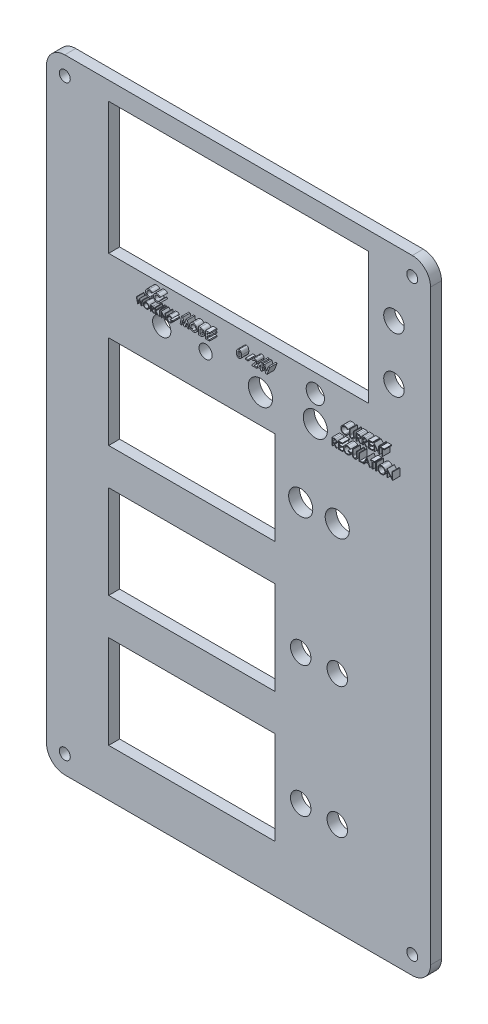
from build123d import *

# Parameters (mm, degrees)
SALIENTE_EXTRUIR1_DEPTH   = 3
CORTAR_EXTRUIR1_REACH     = 102.164
CROQUIS3_W                = 71
CROQUIS3_H                = 36
CORTAR_EXTRUIR2_REACH     = 102.164
CROQUIS6_R                = 3.3
CROQUIS6_R_2              = 2.8
CROQUIS6_R_3              = 1.8
CROQUIS6_R_4              = 2.5
CROQUIS6_W                = 45.5
CROQUIS6_H                = 25.5
F_3_0MM_DOWEL_HOLE1_D     = 3
F_3_0MM_DOWEL_HOLE1_DEPTH = 5
CROQUIS11_W               = 0.692307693
CROQUIS11_H               = 0.333333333
CROQUIS11_W_2             = 0.179487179
CROQUIS11_H_2             = 2
CROQUIS11_W_3             = 0.134615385
CROQUIS11_H_3             = 1.5
SALIENTE_EXTRUIR2_DEPTH   = 2


with BuildPart() as part:
    # Croquis2 → Saliente-Extruir1 (new body)
    with BuildSketch(Plane.XY):
        with BuildLine():
            Line((-47.5, 85.25), (47.5, 85.25))
            ThreePointArc((47.5, 85.25), (51.035533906, 83.785533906), (52.5, 80.25))
            Line((52.5, 80.25), (52.5, -80.25))
            ThreePointArc((52.5, -80.25), (51.035533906, -83.785533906), (47.5, -85.25))
            Line((47.5, -85.25), (-47.5, -85.25))
            ThreePointArc((-47.5, -85.25), (-51.035533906, -83.785533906), (-52.5, -80.25))
            Line((-52.5, -80.25), (-52.5, 80.25))
            ThreePointArc((-52.5, 80.25), (-51.035533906, 83.785533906), (-47.5, 85.25))
        make_face()
    extrude(amount=SALIENTE_EXTRUIR1_DEPTH)

    # Croquis3 → Cortar-Extruir1 (cut, up to next)
    with BuildSketch(Plane.XY.offset(3), mode=Mode.PRIVATE) as cortar_extruir1_sk1:
        with Locations((0, 62.25)):
            Rectangle(CROQUIS3_W, CROQUIS3_H)
    cortar_extruir1_tool1 = extrude(cortar_extruir1_sk1.sketch, amount=-CORTAR_EXTRUIR1_REACH, mode=Mode.PRIVATE) & part.part
    add(cortar_extruir1_tool1.solids().sort_by_distance((0, 62.25, 3))[0], mode=Mode.SUBTRACT)

    # Croquis6 → Cortar-Extruir2 (cut, up to next)
    with BuildSketch(Plane.XY.offset(3), mode=Mode.PRIVATE) as cortar_extruir2_sk1:
        with Locations((21, 32.098495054)):
            Circle(CROQUIS6_R)
    cortar_extruir2_tool1 = extrude(cortar_extruir2_sk1.sketch, amount=-CORTAR_EXTRUIR2_REACH, mode=Mode.PRIVATE) & part.part
    # Croquis6 → Cortar-Extruir2 (cut, up to next)
    with BuildSketch(Plane.XY.offset(3), mode=Mode.PRIVATE) as cortar_extruir2_sk2:
        with Locations((17, -24)):
            Circle(CROQUIS6_R_2)
    cortar_extruir2_tool2 = extrude(cortar_extruir2_sk2.sketch, amount=-CORTAR_EXTRUIR2_REACH, mode=Mode.PRIVATE) & part.part
    # Croquis6 → Cortar-Extruir2 (cut, up to next)
    with BuildSketch(Plane.XY.offset(3), mode=Mode.PRIVATE) as cortar_extruir2_sk3:
        with Locations((27, -24)):
            Circle(CROQUIS6_R_2)
    cortar_extruir2_tool3 = extrude(cortar_extruir2_sk3.sketch, amount=-CORTAR_EXTRUIR2_REACH, mode=Mode.PRIVATE) & part.part
    # Croquis6 → Cortar-Extruir2 (cut, up to next)
    with BuildSketch(Plane.XY.offset(3), mode=Mode.PRIVATE) as cortar_extruir2_sk4:
        with Locations((17, -59.75)):
            Circle(CROQUIS6_R_2)
    cortar_extruir2_tool4 = extrude(cortar_extruir2_sk4.sketch, amount=-CORTAR_EXTRUIR2_REACH, mode=Mode.PRIVATE) & part.part
    # Croquis6 → Cortar-Extruir2 (cut, up to next)
    with BuildSketch(Plane.XY.offset(3), mode=Mode.PRIVATE) as cortar_extruir2_sk5:
        with Locations((27, -59.75)):
            Circle(CROQUIS6_R_2)
    cortar_extruir2_tool5 = extrude(cortar_extruir2_sk5.sketch, amount=-CORTAR_EXTRUIR2_REACH, mode=Mode.PRIVATE) & part.part
    # Croquis6 → Cortar-Extruir2 (cut, up to next)
    with BuildSketch(Plane.XY.offset(3), mode=Mode.PRIVATE) as cortar_extruir2_sk6:
        with Locations((-9, 34.25)):
            Circle(CROQUIS6_R_3)
    cortar_extruir2_tool6 = extrude(cortar_extruir2_sk6.sketch, amount=-CORTAR_EXTRUIR2_REACH, mode=Mode.PRIVATE) & part.part
    # Croquis6 → Cortar-Extruir2 (cut, up to next)
    with BuildSketch(Plane.XY.offset(3), mode=Mode.PRIVATE) as cortar_extruir2_sk7:
        with Locations((42.5, 52.25)):
            Circle(CROQUIS6_R_2)
    cortar_extruir2_tool7 = extrude(cortar_extruir2_sk7.sketch, amount=-CORTAR_EXTRUIR2_REACH, mode=Mode.PRIVATE) & part.part
    # Croquis6 → Cortar-Extruir2 (cut, up to next)
    with BuildSketch(Plane.XY.offset(3), mode=Mode.PRIVATE) as cortar_extruir2_sk8:
        with Locations((42.5, 67.25)):
            Circle(CROQUIS6_R_2)
    cortar_extruir2_tool8 = extrude(cortar_extruir2_sk8.sketch, amount=-CORTAR_EXTRUIR2_REACH, mode=Mode.PRIVATE) & part.part
    # Croquis6 → Cortar-Extruir2 (cut, up to next)
    with BuildSketch(Plane.XY.offset(3), mode=Mode.PRIVATE) as cortar_extruir2_sk9:
        with Locations((6, 32.098495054)):
            Circle(CROQUIS6_R)
    cortar_extruir2_tool9 = extrude(cortar_extruir2_sk9.sketch, amount=-CORTAR_EXTRUIR2_REACH, mode=Mode.PRIVATE) & part.part
    # Croquis6 → Cortar-Extruir2 (cut, up to next)
    with BuildSketch(Plane.XY.offset(3), mode=Mode.PRIVATE) as cortar_extruir2_sk10:
        with Locations((21, 39.25)):
            Circle(CROQUIS6_R_4)
    cortar_extruir2_tool10 = extrude(cortar_extruir2_sk10.sketch, amount=-CORTAR_EXTRUIR2_REACH, mode=Mode.PRIVATE) & part.part
    # Croquis6 → Cortar-Extruir2 (cut, up to next)
    with BuildSketch(Plane.XY.offset(3), mode=Mode.PRIVATE) as cortar_extruir2_sk11:
        with Locations((-21, 34.25)):
            Circle(CROQUIS6_R_4)
    cortar_extruir2_tool11 = extrude(cortar_extruir2_sk11.sketch, amount=-CORTAR_EXTRUIR2_REACH, mode=Mode.PRIVATE) & part.part
    # Croquis6 → Cortar-Extruir2 (cut, up to next)
    with BuildSketch(Plane.XY.offset(3), mode=Mode.PRIVATE) as cortar_extruir2_sk12:
        with Locations((17, 11.5)):
            Circle(CROQUIS6_R)
    cortar_extruir2_tool12 = extrude(cortar_extruir2_sk12.sketch, amount=-CORTAR_EXTRUIR2_REACH, mode=Mode.PRIVATE) & part.part
    # Croquis6 → Cortar-Extruir2 (cut, up to next)
    with BuildSketch(Plane.XY.offset(3), mode=Mode.PRIVATE) as cortar_extruir2_sk13:
        with Locations((27, 11.5)):
            Circle(CROQUIS6_R)
    cortar_extruir2_tool13 = extrude(cortar_extruir2_sk13.sketch, amount=-CORTAR_EXTRUIR2_REACH, mode=Mode.PRIVATE) & part.part
    # Croquis6 → Cortar-Extruir2 (cut, up to next)
    with BuildSketch(Plane.XY.offset(3), mode=Mode.PRIVATE) as cortar_extruir2_sk14:
        with Locations((-12.75, 11.5)):
            Rectangle(CROQUIS6_W, CROQUIS6_H)
    cortar_extruir2_tool14 = extrude(cortar_extruir2_sk14.sketch, amount=-CORTAR_EXTRUIR2_REACH, mode=Mode.PRIVATE) & part.part
    # Croquis6 → Cortar-Extruir2 (cut, up to next)
    with BuildSketch(Plane.XY.offset(3), mode=Mode.PRIVATE) as cortar_extruir2_sk15:
        with Locations((-12.75, -24)):
            Rectangle(CROQUIS6_W, CROQUIS6_H)
    cortar_extruir2_tool15 = extrude(cortar_extruir2_sk15.sketch, amount=-CORTAR_EXTRUIR2_REACH, mode=Mode.PRIVATE) & part.part
    # Croquis6 → Cortar-Extruir2 (cut, up to next)
    with BuildSketch(Plane.XY.offset(3), mode=Mode.PRIVATE) as cortar_extruir2_sk16:
        with Locations((-12.75, -59.5)):
            Rectangle(CROQUIS6_W, CROQUIS6_H)
    cortar_extruir2_tool16 = extrude(cortar_extruir2_sk16.sketch, amount=-CORTAR_EXTRUIR2_REACH, mode=Mode.PRIVATE) & part.part
    add(cortar_extruir2_tool1.solids().sort_by_distance((21, 32.098495, 3))[0], mode=Mode.SUBTRACT)
    add(cortar_extruir2_tool2.solids().sort_by_distance((17, -24, 3))[0], mode=Mode.SUBTRACT)
    add(cortar_extruir2_tool3.solids().sort_by_distance((27, -24, 3))[0], mode=Mode.SUBTRACT)
    add(cortar_extruir2_tool4.solids().sort_by_distance((17, -59.75, 3))[0], mode=Mode.SUBTRACT)
    add(cortar_extruir2_tool5.solids().sort_by_distance((27, -59.75, 3))[0], mode=Mode.SUBTRACT)
    add(cortar_extruir2_tool6.solids().sort_by_distance((-9, 34.25, 3))[0], mode=Mode.SUBTRACT)
    add(cortar_extruir2_tool7.solids().sort_by_distance((42.5, 52.25, 3))[0], mode=Mode.SUBTRACT)
    add(cortar_extruir2_tool8.solids().sort_by_distance((42.5, 67.25, 3))[0], mode=Mode.SUBTRACT)
    add(cortar_extruir2_tool9.solids().sort_by_distance((6, 32.098495, 3))[0], mode=Mode.SUBTRACT)
    add(cortar_extruir2_tool10.solids().sort_by_distance((21, 39.25, 3))[0], mode=Mode.SUBTRACT)
    add(cortar_extruir2_tool11.solids().sort_by_distance((-21, 34.25, 3))[0], mode=Mode.SUBTRACT)
    add(cortar_extruir2_tool12.solids().sort_by_distance((17, 11.5, 3))[0], mode=Mode.SUBTRACT)
    add(cortar_extruir2_tool13.solids().sort_by_distance((27, 11.5, 3))[0], mode=Mode.SUBTRACT)
    add(cortar_extruir2_tool14.solids().sort_by_distance((-12.75, 11.5, 3))[0], mode=Mode.SUBTRACT)
    add(cortar_extruir2_tool15.solids().sort_by_distance((-12.75, -24, 3))[0], mode=Mode.SUBTRACT)
    add(cortar_extruir2_tool16.solids().sort_by_distance((-12.75, -59.5, 3))[0], mode=Mode.SUBTRACT)

    # 3.0mm Dowel Hole1
    with Locations(Plane(origin=(-47.5, 80.25, 3), x_dir=(1, 0, 0), z_dir=(0, 0, 1))):
        with Locations((0, 0), (95, 0), (95, -160.5), (0, -160.5)):
            Hole(F_3_0MM_DOWEL_HOLE1_D / 2, depth=F_3_0MM_DOWEL_HOLE1_DEPTH)

    # Croquis11 → Saliente-Extruir2 (add)
    # profile 1 of 35: a face of its own
    with BuildSketch(Plane.XY.offset(3)):
        with BuildLine():
            Line((-21.512820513, 42.903044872), (-21.776041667, 42.651442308))
            add(Edge.make_bspline(
                [(-21.776041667, 42.651442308), (-21.798370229, 42.674530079), (-21.841984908, 42.719627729), (-21.912264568, 42.779333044), (-21.985352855, 42.829089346), (-22.059827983, 42.870993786), (-22.137029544, 42.902697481), (-22.216064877, 42.925800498), (-22.297438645, 42.939885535), (-22.352509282, 42.941497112), (-22.380208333, 42.942307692)],
                knots=[0, 0, 0, 0, 1.115251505, 2.178435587, 3.19620269, 4.182487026, 5.141301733, 6.088180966, 7.038406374, 8, 8, 8, 8], degree=3))
            add(Edge.make_bspline(
                [(-22.380208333, 42.942307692), (-22.403340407, 42.941667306), (-22.448989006, 42.940403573), (-22.516013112, 42.931139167), (-22.580125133, 42.915384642), (-22.641544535, 42.893671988), (-22.700090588, 42.865576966), (-22.755886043, 42.831121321), (-22.808793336, 42.790616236), (-22.858113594, 42.744271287), (-22.903230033, 42.693635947), (-22.94309328, 42.63960816), (-22.976485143, 42.582311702), (-23.003889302, 42.522326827), (-23.025236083, 42.459375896), (-23.040480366, 42.393501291), (-23.049297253, 42.32462456), (-23.050613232, 42.277802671), (-23.051282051, 42.25400641)],
                knots=[0, 0, 0, 0, 1.035432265, 2.043311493, 3.022114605, 3.98653278, 4.95457646, 5.923598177, 6.917315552, 7.932509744, 8.948865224, 9.949768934, 10.933144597, 11.912367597, 12.897413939, 13.903909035, 14.934704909, 16, 16, 16, 16], degree=3))
            add(Edge.make_bspline(
                [(-23.051282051, 42.25400641), (-23.051089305, 42.237304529), (-23.050709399, 42.204384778), (-23.046550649, 42.155687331), (-23.039854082, 42.108439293), (-23.030162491, 42.062712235), (-23.01804306, 42.018466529), (-23.003824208, 41.975320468), (-22.985986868, 41.933870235), (-22.966187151, 41.893634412), (-22.943160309, 41.855710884), (-22.918333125, 41.819547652), (-22.891412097, 41.785321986), (-22.862222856, 41.7531738), (-22.830354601, 41.7236055), (-22.796631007, 41.69572793), (-22.760483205, 41.670238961), (-22.722662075, 41.64649892), (-22.682840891, 41.625875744), (-22.642100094, 41.607195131), (-22.599821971, 41.592023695), (-22.556521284, 41.579794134), (-22.512352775, 41.569394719), (-22.466884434, 41.56299148), (-22.420510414, 41.558142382), (-22.389169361, 41.557842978), (-22.373397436, 41.557692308)],
                knots=[0, 0, 0, 0, 1.103660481, 2.175337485, 3.227646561, 4.255952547, 5.262355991, 6.258840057, 7.255597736, 8.242457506, 9.22035537, 10.185017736, 11.140346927, 12.096287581, 13.051739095, 14.01125915, 14.986044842, 15.97314143, 16.960198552, 17.947847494, 18.933482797, 19.925264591, 20.920966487, 21.929612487, 22.958107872, 24, 24, 24, 24], degree=3))
            add(Edge.make_bspline(
                [(-22.373397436, 41.557692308), (-22.346645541, 41.558466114), (-22.294085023, 41.559986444), (-22.216944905, 41.571875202), (-22.143438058, 41.591431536), (-22.084706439, 41.614526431), (-22.038691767, 41.63733294), (-22.003661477, 41.658427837), (-21.967437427, 41.682024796), (-21.930621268, 41.709014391), (-21.89279889, 41.739072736), (-21.854637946, 41.772858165), (-21.815161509, 41.809258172), (-21.789300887, 41.835237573), (-21.776041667, 41.848557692)],
                knots=[0, 0, 0, 0, 1.404581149, 2.759636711, 4.088442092, 5.392261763, 6.066678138, 6.783632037, 7.538459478, 8.336747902, 9.180226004, 10.074962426, 11.012997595, 12, 12, 12, 12], degree=3))
            Line((-21.776041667, 41.848557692), (-21.520833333, 41.580528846))
            add(Edge.make_bspline(
                [(-21.520833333, 41.580528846), (-21.538773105, 41.563208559), (-21.573787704, 41.529403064), (-21.626606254, 41.481402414), (-21.67935833, 41.438268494), (-21.730769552, 41.398435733), (-21.781682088, 41.363064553), (-21.83209054, 41.332119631), (-21.881424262, 41.304818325), (-21.930707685, 41.281621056), (-21.980247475, 41.261924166), (-22.031218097, 41.244966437), (-22.083775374, 41.230620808), (-22.1382403, 41.219045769), (-22.194104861, 41.209764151), (-22.251891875, 41.203499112), (-22.311234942, 41.199287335), (-22.351488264, 41.198908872), (-22.371794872, 41.198717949)],
                knots=[0, 0, 0, 0, 1.244526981, 2.429050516, 3.560637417, 4.644440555, 5.67424972, 6.652764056, 7.595344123, 8.486817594, 9.369275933, 10.254498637, 11.166417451, 12.086725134, 13.032340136, 13.991389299, 14.986715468, 16, 16, 16, 16], degree=3))
            add(Edge.make_bspline(
                [(-22.371794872, 41.198717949), (-22.409095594, 41.199668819), (-22.482082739, 41.201529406), (-22.589043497, 41.215315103), (-22.690653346, 41.23842658), (-22.787159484, 41.271112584), (-22.878531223, 41.312867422), (-22.964745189, 41.364056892), (-23.045662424, 41.424544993), (-23.120629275, 41.493622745), (-23.188440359, 41.569913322), (-23.248377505, 41.651828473), (-23.297957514, 41.73977078), (-23.339124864, 41.832441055), (-23.37131719, 41.930262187), (-23.39397513, 42.03333999), (-23.407948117, 42.141574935), (-23.409476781, 42.215501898), (-23.41025641, 42.253205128)],
                knots=[0, 0, 0, 0, 1.078019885, 2.10938526, 3.111377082, 4.085535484, 5.04941344, 6.010039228, 6.978205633, 7.964457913, 8.951525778, 9.924444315, 10.892603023, 11.863865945, 12.85144698, 13.863884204, 14.910567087, 16, 16, 16, 16], degree=3))
            add(Edge.make_bspline(
                [(-23.41025641, 42.253205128), (-23.409926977, 42.277794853), (-23.40927412, 42.326525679), (-23.402412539, 42.398310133), (-23.392847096, 42.468287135), (-23.37767239, 42.535730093), (-23.359380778, 42.601547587), (-23.336632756, 42.665024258), (-23.309464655, 42.726342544), (-23.278752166, 42.785605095), (-23.244007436, 42.84242368), (-23.205193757, 42.896310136), (-23.163310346, 42.947680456), (-23.117350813, 42.995853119), (-23.06798301, 43.04125109), (-23.014984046, 43.083628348), (-22.958672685, 43.12359263), (-22.898896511, 43.160113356), (-22.836816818, 43.193148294), (-22.773216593, 43.22228652), (-22.708252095, 43.246639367), (-22.642197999, 43.266839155), (-22.574775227, 43.281916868), (-22.506465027, 43.293330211), (-22.436686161, 43.299710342), (-22.389835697, 43.300754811), (-22.366185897, 43.301282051)],
                knots=[0, 0, 0, 0, 1.071919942, 2.124283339, 3.142214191, 4.149696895, 5.136002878, 6.119640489, 7.086990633, 8.058538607, 9.028339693, 9.988281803, 10.952401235, 11.916291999, 12.888973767, 13.874849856, 14.873389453, 15.898127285, 16.927174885, 17.938320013, 18.946391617, 19.950418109, 20.947802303, 21.956882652, 22.968648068, 24, 24, 24, 24], degree=3))
            add(Edge.make_bspline(
                [(-22.366185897, 43.301282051), (-22.346010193, 43.300979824), (-22.305868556, 43.300378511), (-22.246090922, 43.295365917), (-22.186791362, 43.287493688), (-22.128182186, 43.27561617), (-22.069844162, 43.261516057), (-22.012543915, 43.243053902), (-21.955377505, 43.222474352), (-21.899241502, 43.197875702), (-21.844057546, 43.171024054), (-21.791118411, 43.140559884), (-21.739535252, 43.108357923), (-21.690451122, 43.072512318), (-21.642946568, 43.034323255), (-21.597269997, 42.993612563), (-21.553822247, 42.949701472), (-21.526556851, 42.918675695), (-21.512820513, 42.903044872)],
                knots=[0, 0, 0, 0, 0.996412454, 1.982464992, 2.961075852, 3.949442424, 4.934965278, 5.923860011, 6.921385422, 7.934793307, 8.949617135, 9.951082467, 10.950285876, 11.951772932, 12.951063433, 13.960125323, 14.972308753, 16, 16, 16, 16], degree=3))
        make_face()
    # profile 2 of 35: a face of its own
    with BuildSketch(Plane.XY.offset(3)):
        with BuildLine():
            Line((-19.358974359, 42.903044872), (-19.622195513, 42.651442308))
            add(Edge.make_bspline(
                [(-19.622195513, 42.651442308), (-19.644524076, 42.674530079), (-19.688138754, 42.719627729), (-19.758418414, 42.779333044), (-19.831506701, 42.829089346), (-19.905981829, 42.870993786), (-19.98318339, 42.902697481), (-20.062218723, 42.925800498), (-20.143592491, 42.939885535), (-20.198663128, 42.941497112), (-20.226362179, 42.942307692)],
                knots=[0, 0, 0, 0, 1.115251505, 2.178435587, 3.19620269, 4.182487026, 5.141301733, 6.088180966, 7.038406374, 8, 8, 8, 8], degree=3))
            add(Edge.make_bspline(
                [(-20.226362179, 42.942307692), (-20.249494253, 42.941667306), (-20.295142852, 42.940403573), (-20.362166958, 42.931139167), (-20.426278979, 42.915384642), (-20.487698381, 42.893671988), (-20.546244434, 42.865576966), (-20.602039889, 42.831121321), (-20.654947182, 42.790616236), (-20.704267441, 42.744271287), (-20.74938388, 42.693635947), (-20.789247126, 42.63960816), (-20.822638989, 42.582311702), (-20.850043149, 42.522326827), (-20.871389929, 42.459375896), (-20.886634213, 42.393501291), (-20.895451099, 42.32462456), (-20.896767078, 42.277802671), (-20.897435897, 42.25400641)],
                knots=[0, 0, 0, 0, 1.035432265, 2.043311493, 3.022114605, 3.98653278, 4.95457646, 5.923598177, 6.917315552, 7.932509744, 8.948865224, 9.949768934, 10.933144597, 11.912367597, 12.897413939, 13.903909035, 14.934704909, 16, 16, 16, 16], degree=3))
            add(Edge.make_bspline(
                [(-20.897435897, 42.25400641), (-20.897243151, 42.237304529), (-20.896863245, 42.204384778), (-20.892704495, 42.155687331), (-20.886007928, 42.108439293), (-20.876316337, 42.062712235), (-20.864196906, 42.018466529), (-20.849978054, 41.975320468), (-20.832140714, 41.933870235), (-20.812340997, 41.893634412), (-20.789314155, 41.855710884), (-20.764486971, 41.819547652), (-20.737565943, 41.785321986), (-20.708376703, 41.7531738), (-20.676508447, 41.7236055), (-20.642784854, 41.69572793), (-20.606637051, 41.670238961), (-20.568815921, 41.64649892), (-20.528994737, 41.625875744), (-20.48825394, 41.607195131), (-20.445975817, 41.592023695), (-20.402675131, 41.579794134), (-20.358506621, 41.569394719), (-20.31303828, 41.56299148), (-20.26666426, 41.558142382), (-20.235323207, 41.557842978), (-20.219551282, 41.557692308)],
                knots=[0, 0, 0, 0, 1.103660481, 2.175337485, 3.227646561, 4.255952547, 5.262355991, 6.258840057, 7.255597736, 8.242457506, 9.22035537, 10.185017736, 11.140346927, 12.096287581, 13.051739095, 14.01125915, 14.986044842, 15.97314143, 16.960198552, 17.947847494, 18.933482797, 19.925264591, 20.920966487, 21.929612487, 22.958107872, 24, 24, 24, 24], degree=3))
            add(Edge.make_bspline(
                [(-20.219551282, 41.557692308), (-20.192799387, 41.558466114), (-20.140238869, 41.559986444), (-20.063098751, 41.571875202), (-19.989591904, 41.591431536), (-19.930860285, 41.614526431), (-19.884845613, 41.63733294), (-19.849815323, 41.658427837), (-19.813591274, 41.682024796), (-19.776775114, 41.709014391), (-19.738952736, 41.739072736), (-19.700791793, 41.772858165), (-19.661315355, 41.809258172), (-19.635454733, 41.835237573), (-19.622195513, 41.848557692)],
                knots=[0, 0, 0, 0, 1.404581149, 2.759636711, 4.088442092, 5.392261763, 6.066678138, 6.783632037, 7.538459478, 8.336747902, 9.180226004, 10.074962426, 11.012997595, 12, 12, 12, 12], degree=3))
            Line((-19.622195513, 41.848557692), (-19.366987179, 41.580528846))
            add(Edge.make_bspline(
                [(-19.366987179, 41.580528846), (-19.384926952, 41.563208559), (-19.41994155, 41.529403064), (-19.4727601, 41.481402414), (-19.525512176, 41.438268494), (-19.576923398, 41.398435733), (-19.627835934, 41.363064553), (-19.678244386, 41.332119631), (-19.727578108, 41.304818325), (-19.776861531, 41.281621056), (-19.826401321, 41.261924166), (-19.877371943, 41.244966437), (-19.92992922, 41.230620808), (-19.984394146, 41.219045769), (-20.040258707, 41.209764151), (-20.098045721, 41.203499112), (-20.157388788, 41.199287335), (-20.197642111, 41.198908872), (-20.217948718, 41.198717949)],
                knots=[0, 0, 0, 0, 1.244526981, 2.429050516, 3.560637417, 4.644440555, 5.67424972, 6.652764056, 7.595344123, 8.486817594, 9.369275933, 10.254498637, 11.166417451, 12.086725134, 13.032340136, 13.991389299, 14.986715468, 16, 16, 16, 16], degree=3))
            add(Edge.make_bspline(
                [(-20.217948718, 41.198717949), (-20.25524944, 41.199668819), (-20.328236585, 41.201529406), (-20.435197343, 41.215315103), (-20.536807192, 41.23842658), (-20.63331333, 41.271112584), (-20.72468507, 41.312867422), (-20.810899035, 41.364056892), (-20.89181627, 41.424544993), (-20.966783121, 41.493622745), (-21.034594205, 41.569913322), (-21.094531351, 41.651828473), (-21.14411136, 41.73977078), (-21.18527871, 41.832441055), (-21.217471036, 41.930262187), (-21.240128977, 42.03333999), (-21.254101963, 42.141574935), (-21.255630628, 42.215501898), (-21.256410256, 42.253205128)],
                knots=[0, 0, 0, 0, 1.078019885, 2.10938526, 3.111377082, 4.085535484, 5.04941344, 6.010039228, 6.978205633, 7.964457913, 8.951525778, 9.924444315, 10.892603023, 11.863865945, 12.85144698, 13.863884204, 14.910567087, 16, 16, 16, 16], degree=3))
            add(Edge.make_bspline(
                [(-21.256410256, 42.253205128), (-21.256080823, 42.277794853), (-21.255427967, 42.326525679), (-21.248566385, 42.398310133), (-21.239000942, 42.468287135), (-21.223826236, 42.535730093), (-21.205534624, 42.601547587), (-21.182786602, 42.665024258), (-21.155618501, 42.726342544), (-21.124906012, 42.785605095), (-21.090161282, 42.84242368), (-21.051347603, 42.896310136), (-21.009464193, 42.947680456), (-20.963504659, 42.995853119), (-20.914136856, 43.04125109), (-20.861137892, 43.083628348), (-20.804826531, 43.12359263), (-20.745050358, 43.160113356), (-20.682970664, 43.193148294), (-20.619370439, 43.22228652), (-20.554405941, 43.246639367), (-20.488351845, 43.266839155), (-20.420929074, 43.281916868), (-20.352618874, 43.293330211), (-20.282840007, 43.299710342), (-20.235989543, 43.300754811), (-20.212339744, 43.301282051)],
                knots=[0, 0, 0, 0, 1.071919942, 2.124283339, 3.142214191, 4.149696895, 5.136002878, 6.119640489, 7.086990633, 8.058538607, 9.028339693, 9.988281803, 10.952401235, 11.916291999, 12.888973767, 13.874849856, 14.873389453, 15.898127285, 16.927174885, 17.938320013, 18.946391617, 19.950418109, 20.947802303, 21.956882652, 22.968648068, 24, 24, 24, 24], degree=3))
            add(Edge.make_bspline(
                [(-20.212339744, 43.301282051), (-20.192164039, 43.300979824), (-20.152022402, 43.300378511), (-20.092244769, 43.295365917), (-20.032945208, 43.287493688), (-19.974336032, 43.27561617), (-19.915998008, 43.261516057), (-19.858697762, 43.243053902), (-19.801531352, 43.222474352), (-19.745395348, 43.197875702), (-19.690211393, 43.171024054), (-19.637272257, 43.140559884), (-19.585689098, 43.108357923), (-19.536604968, 43.072512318), (-19.489100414, 43.034323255), (-19.443423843, 42.993612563), (-19.399976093, 42.949701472), (-19.372710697, 42.918675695), (-19.358974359, 42.903044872)],
                knots=[0, 0, 0, 0, 0.996412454, 1.982464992, 2.961075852, 3.949442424, 4.934965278, 5.923860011, 6.921385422, 7.934793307, 8.949617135, 9.951082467, 10.950285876, 11.951772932, 12.951063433, 13.960125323, 14.972308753, 16, 16, 16, 16], degree=3))
        make_face()
    # profile 3 of 35: a face of its own
    with BuildSketch(Plane.XY.offset(3)):
        Polygon((-13.610977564, 41.25), (-13.23838141, 41.25), (-12.782051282, 39.854967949), (-12.322516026, 41.25), (-11.953525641, 41.25), (-11.615384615, 39.25), (-11.978766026, 39.25), (-12.192307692, 40.513221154), (-12.608173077, 39.25), (-12.958333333, 39.25), (-13.371794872, 40.513221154), (-13.584935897, 39.25), (-13.948717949, 39.25), align=None)
    # profile 4 of 35: a face of its own
    with BuildSketch(Plane.XY.offset(3)):
        with BuildLine():
            add(Edge.make_bspline(
                [(-10.342147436, 41.301282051), (-10.307374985, 41.30038173), (-10.23872629, 41.298604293), (-10.137768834, 41.283787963), (-10.040477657, 41.259646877), (-9.946896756, 41.226089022), (-9.857260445, 41.182205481), (-9.771252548, 41.12924038), (-9.689181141, 41.066194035), (-9.611887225, 40.994537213), (-9.540453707, 40.916613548), (-9.478556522, 40.832714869), (-9.425772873, 40.745015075), (-9.382025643, 40.653279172), (-9.348703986, 40.556871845), (-9.3253208, 40.456284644), (-9.310298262, 40.351546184), (-9.308570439, 40.280233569), (-9.307692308, 40.243990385)],
                knots=[0, 0, 0, 0, 1.014329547, 2.002516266, 2.970391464, 3.935626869, 4.897733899, 5.877609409, 6.878433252, 7.912639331, 8.949961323, 9.958554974, 10.949718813, 11.932905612, 12.9188844, 13.919928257, 14.942845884, 16, 16, 16, 16], degree=3))
            add(Edge.make_bspline(
                [(-9.307692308, 40.243990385), (-9.308627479, 40.208155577), (-9.310470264, 40.137541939), (-9.324707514, 40.033768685), (-9.348484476, 39.934258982), (-9.381240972, 39.838787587), (-9.424194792, 39.747816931), (-9.475949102, 39.660766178), (-9.537869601, 39.578443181), (-9.607697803, 39.500892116), (-9.684572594, 39.430497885), (-9.765995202, 39.36846309), (-9.851589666, 39.315897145), (-9.941230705, 39.27282413), (-10.035110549, 39.239396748), (-10.132997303, 39.215811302), (-10.23488491, 39.20147795), (-10.304173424, 39.199647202), (-10.339342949, 39.198717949)],
                knots=[0, 0, 0, 0, 1.051557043, 2.072126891, 3.067553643, 4.050577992, 5.02905126, 6.015227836, 7.017913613, 8.04756643, 9.074058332, 10.072836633, 11.047628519, 12.017157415, 12.98668631, 13.966869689, 14.968021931, 16, 16, 16, 16], degree=3))
            add(Edge.make_bspline(
                [(-10.339342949, 39.198717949), (-10.376126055, 39.199551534), (-10.44839983, 39.201189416), (-10.554172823, 39.216764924), (-10.655512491, 39.240227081), (-10.751567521, 39.27524309), (-10.843316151, 39.319016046), (-10.930084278, 39.372925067), (-11.011842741, 39.436881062), (-11.088122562, 39.509246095), (-11.157232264, 39.588429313), (-11.218235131, 39.672079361), (-11.269692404, 39.759557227), (-11.311605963, 39.850903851), (-11.34464893, 39.945551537), (-11.367956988, 40.044076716), (-11.381725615, 40.146243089), (-11.383643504, 40.215636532), (-11.384615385, 40.250801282)],
                knots=[0, 0, 0, 0, 1.067978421, 2.098431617, 3.099715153, 4.085208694, 5.062210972, 6.048429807, 7.046490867, 8.072918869, 9.098532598, 10.095778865, 11.076610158, 12.041847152, 13.011192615, 13.984257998, 14.978533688, 16, 16, 16, 16], degree=3))
            add(Edge.make_bspline(
                [(-11.384615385, 40.250801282), (-11.384310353, 40.274458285), (-11.383704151, 40.32147274), (-11.376401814, 40.391145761), (-11.365888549, 40.459458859), (-11.350339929, 40.526139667), (-11.331452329, 40.591658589), (-11.306980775, 40.655405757), (-11.279125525, 40.718062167), (-11.246579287, 40.778887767), (-11.210391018, 40.837322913), (-11.170906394, 40.893091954), (-11.128026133, 40.945520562), (-11.081888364, 40.994953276), (-11.032334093, 41.04106517), (-10.980015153, 41.084509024), (-10.923916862, 41.124130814), (-10.865267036, 41.160898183), (-10.804396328, 41.194146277), (-10.741552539, 41.22244606), (-10.678030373, 41.247159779), (-10.612981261, 41.266664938), (-10.54710232, 41.282551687), (-10.479689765, 41.293057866), (-10.411352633, 41.30036), (-10.365270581, 41.300973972), (-10.342147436, 41.301282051)],
                knots=[0, 0, 0, 0, 1.034744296, 2.056386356, 3.06226378, 4.057406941, 5.050368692, 6.043467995, 7.042652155, 8.049140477, 9.059438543, 10.048523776, 11.036952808, 12.020949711, 13.004946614, 13.997082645, 14.994316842, 16.007702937, 17.024872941, 18.026463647, 19.021641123, 20.005082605, 20.995858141, 21.984425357, 22.988620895, 24, 24, 24, 24], degree=3))
        make_face()
        with BuildLine():
            add(Edge.make_bspline(
                [(-10.34775641, 40.942307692), (-10.371158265, 40.941679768), (-10.417344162, 40.940440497), (-10.485090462, 40.930998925), (-10.550129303, 40.915919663), (-10.612100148, 40.894077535), (-10.671271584, 40.86627805), (-10.727748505, 40.832618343), (-10.780748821, 40.791941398), (-10.83097924, 40.74643098), (-10.876354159, 40.695721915), (-10.916444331, 40.641378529), (-10.949993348, 40.583491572), (-10.978090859, 40.522598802), (-10.999242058, 40.458015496), (-11.014307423, 40.390247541), (-11.023828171, 40.31917817), (-11.025028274, 40.270730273), (-11.025641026, 40.24599359)],
                knots=[0, 0, 0, 0, 1.033739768, 2.040188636, 3.016340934, 3.979330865, 4.937572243, 5.900995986, 6.878200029, 7.884839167, 8.891893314, 9.879764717, 10.863503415, 11.843163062, 12.837761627, 13.859916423, 14.907309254, 16, 16, 16, 16], degree=3))
            add(Edge.make_bspline(
                [(-11.025641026, 40.24599359), (-11.02482861, 40.21857978), (-11.02323641, 40.164853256), (-11.012033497, 40.08647845), (-10.992866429, 40.012461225), (-10.965189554, 39.943163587), (-10.930862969, 39.877816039), (-10.888234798, 39.817219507), (-10.837995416, 39.761011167), (-10.799291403, 39.728194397), (-10.779647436, 39.711538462)],
                knots=[0, 0, 0, 0, 1.078454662, 2.113592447, 3.107694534, 4.079536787, 5.043276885, 6.005368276, 6.987637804, 8, 8, 8, 8], degree=3))
            add(Edge.make_bspline(
                [(-10.779647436, 39.711538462), (-10.763555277, 39.699233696), (-10.731733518, 39.674901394), (-10.680939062, 39.643714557), (-10.628630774, 39.616984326), (-10.574413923, 39.595386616), (-10.518403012, 39.578398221), (-10.460605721, 39.566501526), (-10.401103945, 39.559035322), (-10.360866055, 39.558142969), (-10.340544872, 39.557692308)],
                knots=[0, 0, 0, 0, 1.023928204, 2.024787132, 3.009472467, 3.9914905, 4.972207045, 5.96565515, 6.972602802, 8, 8, 8, 8], degree=3))
            add(Edge.make_bspline(
                [(-10.340544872, 39.557692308), (-10.317545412, 39.558325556), (-10.272293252, 39.559571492), (-10.205808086, 39.568896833), (-10.142113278, 39.584678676), (-10.080813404, 39.606329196), (-10.022085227, 39.634477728), (-9.966215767, 39.669181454), (-9.913107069, 39.710014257), (-9.862940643, 39.756122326), (-9.817086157, 39.80703115), (-9.777079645, 39.861664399), (-9.742463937, 39.918818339), (-9.714950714, 39.979301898), (-9.692963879, 40.04254414), (-9.678079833, 40.10882515), (-9.668478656, 40.177871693), (-9.667278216, 40.224860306), (-9.666666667, 40.248798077)],
                knots=[0, 0, 0, 0, 1.026359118, 2.019393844, 2.989460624, 3.950973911, 4.916101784, 5.890408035, 6.881132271, 7.902007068, 8.92769091, 9.933912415, 10.920395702, 11.90457117, 12.894218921, 13.903490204, 14.931958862, 16, 16, 16, 16], degree=3))
            add(Edge.make_bspline(
                [(-9.666666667, 40.248798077), (-9.667299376, 40.272598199), (-9.668544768, 40.31944511), (-9.677886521, 40.388314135), (-9.69356828, 40.454302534), (-9.715283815, 40.517518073), (-9.743013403, 40.578022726), (-9.777303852, 40.635603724), (-9.81803484, 40.690205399), (-9.864268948, 40.741455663), (-9.914591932, 40.788551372), (-9.968618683, 40.829421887), (-10.024837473, 40.864937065), (-10.084538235, 40.892758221), (-10.146499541, 40.914923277), (-10.211099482, 40.931245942), (-10.278582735, 40.940374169), (-10.324492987, 40.94165744), (-10.34775641, 40.942307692)],
                knots=[0, 0, 0, 0, 1.055025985, 2.07665775, 3.074803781, 4.057872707, 5.035505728, 6.020516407, 7.023567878, 8.050795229, 9.077271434, 10.074415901, 11.050397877, 12.019801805, 12.988065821, 13.964604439, 14.968634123, 16, 16, 16, 16], degree=3))
        make_face(mode=Mode.SUBTRACT)
    # profile 5 of 35: a face of its own
    with BuildSketch(Plane.XY.offset(3)):
        with BuildLine():
            Line((-8.948717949, 41.25), (-8.496394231, 41.25))
            add(Edge.make_bspline(
                [(-8.496394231, 41.25), (-8.461130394, 41.249753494), (-8.392965, 41.249276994), (-8.294206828, 41.243907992), (-8.202374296, 41.235650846), (-8.117408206, 41.224291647), (-8.039482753, 41.209260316), (-7.968698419, 41.190406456), (-7.904817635, 41.168642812), (-7.847139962, 41.143033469), (-7.794485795, 41.113175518), (-7.744488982, 41.079916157), (-7.697247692, 41.042037), (-7.652098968, 41.00026881), (-7.609625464, 40.953847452), (-7.569119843, 40.903541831), (-7.531573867, 40.848622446), (-7.495852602, 40.790406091), (-7.463547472, 40.728646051), (-7.43536973, 40.663868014), (-7.411765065, 40.596488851), (-7.392585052, 40.526436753), (-7.377296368, 40.453944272), (-7.366599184, 40.378865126), (-7.359986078, 40.301268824), (-7.359315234, 40.248678), (-7.358974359, 40.221955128)],
                knots=[0, 0, 0, 0, 1.44355588, 2.790409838, 4.047694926, 5.217575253, 6.298404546, 7.294384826, 8.214239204, 9.058592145, 9.873746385, 10.689560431, 11.514393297, 12.350027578, 13.205127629, 14.088021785, 14.991911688, 15.926770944, 16.882954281, 17.842803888, 18.816321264, 19.80318086, 20.814351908, 21.847355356, 22.906180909, 24, 24, 24, 24], degree=3))
            add(Edge.make_bspline(
                [(-7.358974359, 40.221955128), (-7.359866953, 40.184247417), (-7.361624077, 40.110017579), (-7.376425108, 40.001086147), (-7.400363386, 39.896664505), (-7.434022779, 39.79756948), (-7.475751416, 39.704683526), (-7.525600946, 39.61964465), (-7.582840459, 39.542909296), (-7.64680311, 39.474859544), (-7.716059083, 39.416369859), (-7.788030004, 39.366277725), (-7.863417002, 39.326775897), (-7.929843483, 39.301725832), (-7.987443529, 39.286146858), (-8.038015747, 39.276939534), (-8.095460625, 39.268495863), (-8.160313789, 39.261970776), (-8.232290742, 39.256152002), (-8.311678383, 39.252990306), (-8.39821968, 39.250363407), (-8.458330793, 39.25012431), (-8.489583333, 39.25)],
                knots=[0, 0, 0, 0, 1.315458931, 2.589557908, 3.828601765, 5.048913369, 6.235739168, 7.376350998, 8.481830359, 9.569842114, 10.627874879, 11.640079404, 12.624025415, 13.590060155, 14.111227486, 14.704434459, 15.382649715, 16.137166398, 16.978595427, 17.902333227, 18.909396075, 20, 20, 20, 20], degree=3))
            Line((-8.489583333, 39.25), (-8.948717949, 39.25))
            Line((-8.948717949, 39.25), (-8.948717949, 41.25))
        make_face()
        with BuildLine():
            Line((-8.58974359, 40.891025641), (-8.58974359, 39.608974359))
            Line((-8.58974359, 39.608974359), (-8.40224359, 39.608974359))
            add(Edge.make_bspline(
                [(-8.40224359, 39.608974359), (-8.379933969, 39.609015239), (-8.337025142, 39.609093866), (-8.275074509, 39.612838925), (-8.217785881, 39.616597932), (-8.165316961, 39.623732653), (-8.117285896, 39.63168023), (-8.074352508, 39.642740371), (-8.035631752, 39.654358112), (-8.001596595, 39.669148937), (-7.970423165, 39.685796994), (-7.941560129, 39.705302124), (-7.913699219, 39.726961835), (-7.887361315, 39.751413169), (-7.862446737, 39.778332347), (-7.839102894, 39.807858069), (-7.817018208, 39.839900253), (-7.79675955, 39.874628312), (-7.77824708, 39.911675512), (-7.761824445, 39.950682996), (-7.748207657, 39.991975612), (-7.736890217, 40.035166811), (-7.728802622, 40.080632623), (-7.72211168, 40.128036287), (-7.718662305, 40.177565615), (-7.718188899, 40.211267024), (-7.717948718, 40.228365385)],
                knots=[0, 0, 0, 0, 1.50275155, 2.890291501, 4.180787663, 5.369391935, 6.45668281, 7.458360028, 8.354766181, 9.177074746, 9.954075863, 10.732690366, 11.5210699, 12.329727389, 13.151100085, 13.990027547, 14.863562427, 15.770965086, 16.696477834, 17.652329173, 18.619756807, 19.62365428, 20.657822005, 21.729286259, 22.847956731, 24, 24, 24, 24], degree=3))
            add(Edge.make_bspline(
                [(-7.717948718, 40.228365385), (-7.718427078, 40.254567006), (-7.719359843, 40.305658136), (-7.728355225, 40.380073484), (-7.742997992, 40.450146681), (-7.763891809, 40.515617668), (-7.790229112, 40.576670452), (-7.823196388, 40.632787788), (-7.86137485, 40.684912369), (-7.891565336, 40.71549032), (-7.906650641, 40.730769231)],
                knots=[0, 0, 0, 0, 1.13821349, 2.219428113, 3.251817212, 4.244760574, 5.201143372, 6.134805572, 7.068016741, 8, 8, 8, 8], degree=3))
            add(Edge.make_bspline(
                [(-7.906650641, 40.730769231), (-7.921526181, 40.743788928), (-7.951907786, 40.770380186), (-8.0052479, 40.802243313), (-8.064025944, 40.830238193), (-8.129586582, 40.852435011), (-8.201296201, 40.8699892), (-8.279581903, 40.882095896), (-8.364024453, 40.88987553), (-8.422524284, 40.890634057), (-8.452724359, 40.891025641)],
                knots=[0, 0, 0, 0, 0.813307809, 1.661089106, 2.549956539, 3.493439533, 4.508053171, 5.589449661, 6.755572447, 8, 8, 8, 8], degree=3))
            Line((-8.452724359, 40.891025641), (-8.58974359, 40.891025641))
        make_face(mode=Mode.SUBTRACT)
    # profile 6 of 35: a face of its own
    with BuildSketch(Plane.XY.offset(3)):
        Polygon((-7, 41.25), (-5.923076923, 41.25), (-5.923076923, 40.891025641), (-6.641025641, 40.891025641), (-6.641025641, 40.506410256), (-5.923076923, 40.506410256), (-5.923076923, 40.147435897), (-6.641025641, 40.147435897), (-6.641025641, 39.608974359), (-5.923076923, 39.608974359), (-5.923076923, 39.25), (-7, 39.25), align=None)
    # profile 7 of 35: a face of its own
    with BuildSketch(Plane.XY.offset(3)):
        with BuildLine():
            add(Edge.make_bspline(
                [(2.122195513, 41.301282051), (2.139571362, 41.301024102), (2.173736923, 41.300516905), (2.224056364, 41.295023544), (2.272527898, 41.286724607), (2.319341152, 41.275150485), (2.364159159, 41.259832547), (2.407308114, 41.241497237), (2.448274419, 41.219182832), (2.487580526, 41.193977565), (2.525211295, 41.165441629), (2.560262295, 41.132909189), (2.593373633, 41.097128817), (2.62382857, 41.057559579), (2.65230154, 41.014561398), (2.678698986, 40.968127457), (2.702818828, 40.918030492), (2.724931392, 40.864180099), (2.744704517, 40.805769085), (2.761359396, 40.74212745), (2.775643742, 40.673240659), (2.787700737, 40.598937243), (2.796813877, 40.519118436), (2.802956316, 40.433837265), (2.807171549, 40.34325814), (2.807515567, 40.281121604), (2.807692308, 40.249198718)],
                knots=[0, 0, 0, 0, 0.879237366, 1.728815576, 2.559023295, 3.367336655, 4.166867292, 4.954216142, 5.737608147, 6.525189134, 7.316157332, 8.124696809, 8.942788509, 9.781158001, 10.649253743, 11.551476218, 12.482711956, 13.461909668, 14.496590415, 15.601789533, 16.789733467, 18.056700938, 19.410929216, 20.8549011, 22.384193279, 24, 24, 24, 24], degree=3))
            add(Edge.make_bspline(
                [(2.807692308, 40.249198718), (2.807501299, 40.216876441), (2.807130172, 40.154074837), (2.803131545, 40.062667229), (2.796245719, 39.976766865), (2.787370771, 39.896382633), (2.775214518, 39.821556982), (2.760977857, 39.752096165), (2.744060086, 39.688025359), (2.723635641, 39.629488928), (2.701656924, 39.575543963), (2.677471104, 39.525544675), (2.651499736, 39.479355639), (2.624338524, 39.436280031), (2.594498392, 39.397587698), (2.563431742, 39.361962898), (2.529785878, 39.330762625), (2.49497742, 39.302378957), (2.457731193, 39.277849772), (2.418431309, 39.256396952), (2.376377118, 39.238996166), (2.332335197, 39.223861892), (2.285554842, 39.212997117), (2.236779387, 39.204376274), (2.185458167, 39.199611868), (2.150516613, 39.199020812), (2.132612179, 39.198717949)],
                knots=[0, 0, 0, 0, 1.643780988, 3.193836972, 4.651895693, 6.025988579, 7.305620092, 8.505800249, 9.631074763, 10.672816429, 11.65661981, 12.592235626, 13.49536222, 14.350718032, 15.179365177, 15.97804903, 16.751647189, 17.51006938, 18.259804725, 19.016521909, 19.783502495, 20.571750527, 21.382245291, 22.22305063, 23.089471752, 24, 24, 24, 24], degree=3))
            add(Edge.make_bspline(
                [(2.132612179, 39.198717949), (2.114708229, 39.199026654), (2.079634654, 39.199631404), (2.028174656, 39.204340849), (1.979140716, 39.21303204), (1.931990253, 39.223945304), (1.887051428, 39.23896268), (1.844108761, 39.256884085), (1.803492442, 39.27820305), (1.765090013, 39.302789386), (1.72903259, 39.330983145), (1.694759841, 39.362482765), (1.662347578, 39.3972084), (1.632288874, 39.435549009), (1.604091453, 39.476992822), (1.57804937, 39.522013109), (1.554178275, 39.570544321), (1.531731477, 39.622654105), (1.512228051, 39.679464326), (1.494870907, 39.741482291), (1.480652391, 39.809224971), (1.469216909, 39.882670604), (1.460086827, 39.961663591), (1.453295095, 40.046242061), (1.449274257, 40.136445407), (1.448907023, 40.19844666), (1.448717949, 40.23036859)],
                knots=[0, 0, 0, 0, 0.917216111, 1.796812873, 2.643793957, 3.46689424, 4.273913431, 5.068098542, 5.848489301, 6.620921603, 7.401012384, 8.190319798, 9.003608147, 9.831726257, 10.68377682, 11.569763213, 12.493818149, 13.453288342, 14.474581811, 15.568529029, 16.750744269, 18.018426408, 19.375425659, 20.823733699, 22.36466933, 24, 24, 24, 24], degree=3))
            add(Edge.make_bspline(
                [(1.448717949, 40.23036859), (1.449060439, 40.274721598), (1.449721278, 40.3603013), (1.458095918, 40.483939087), (1.470387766, 40.598220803), (1.488441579, 40.702955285), (1.510764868, 40.798530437), (1.539351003, 40.884316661), (1.571894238, 40.961501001), (1.599625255, 41.007225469), (1.612980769, 41.029246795)],
                knots=[0, 0, 0, 0, 1.288568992, 2.486310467, 3.599230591, 4.627010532, 5.572937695, 6.447898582, 7.252493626, 8, 8, 8, 8], degree=3))
            add(Edge.make_bspline(
                [(1.612980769, 41.029246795), (1.628509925, 41.050880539), (1.658872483, 41.09317877), (1.711962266, 41.148708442), (1.769000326, 41.196200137), (1.831158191, 41.234579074), (1.897452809, 41.264844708), (1.968453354, 41.286220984), (2.043897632, 41.298675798), (2.095706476, 41.300400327), (2.122195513, 41.301282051)],
                knots=[0, 0, 0, 0, 1.058512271, 2.069600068, 3.047294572, 4.004278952, 4.967380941, 5.939006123, 6.946246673, 8, 8, 8, 8], degree=3))
        make_face()
        with BuildLine():
            add(Edge.make_bspline(
                [(2.131009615, 40.942307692), (2.115301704, 40.941563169), (2.084505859, 40.940103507), (2.039819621, 40.927713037), (1.997683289, 40.908575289), (1.965631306, 40.885546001), (1.941640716, 40.863469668), (1.924878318, 40.843491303), (1.908713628, 40.821196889), (1.894436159, 40.795580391), (1.880954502, 40.767562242), (1.867778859, 40.737015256), (1.856978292, 40.703189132), (1.846367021, 40.666659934), (1.837070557, 40.626417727), (1.829282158, 40.582133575), (1.822323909, 40.533519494), (1.817470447, 40.480543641), (1.812945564, 40.423261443), (1.809701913, 40.361545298), (1.808345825, 40.295411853), (1.807914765, 40.249866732), (1.807692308, 40.226362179)],
                knots=[0, 0, 0, 0, 1.076674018, 2.110852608, 3.161083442, 4.239746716, 4.804137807, 5.395870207, 6.026861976, 6.692161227, 7.405688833, 8.16177676, 8.973626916, 9.841385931, 10.773283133, 11.807421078, 12.927755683, 14.143907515, 15.458935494, 16.872852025, 18.386167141, 20, 20, 20, 20], degree=3))
            add(Edge.make_bspline(
                [(1.807692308, 40.226362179), (1.808058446, 40.195910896), (1.808760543, 40.137518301), (1.8124378, 40.053547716), (1.819808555, 39.977127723), (1.828976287, 39.907740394), (1.841852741, 39.845835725), (1.856667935, 39.79082804), (1.874963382, 39.743418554), (1.896107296, 39.702921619), (1.919525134, 39.668470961), (1.944946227, 39.639187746), (1.971505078, 39.613829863), (2.000030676, 39.593231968), (2.030454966, 39.57744669), (2.062523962, 39.566092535), (2.096258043, 39.559142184), (2.119358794, 39.558178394), (2.131009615, 39.557692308)],
                knots=[0, 0, 0, 0, 1.771748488, 3.397459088, 4.888034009, 6.237357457, 7.467047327, 8.564189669, 9.548206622, 10.417051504, 11.216568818, 11.965764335, 12.669334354, 13.348544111, 14.005342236, 14.656555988, 15.322436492, 16, 16, 16, 16], degree=3))
            add(Edge.make_bspline(
                [(2.131009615, 39.557692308), (2.142260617, 39.558024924), (2.16428868, 39.558676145), (2.196410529, 39.565360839), (2.226787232, 39.576228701), (2.255327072, 39.591602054), (2.282132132, 39.611151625), (2.307071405, 39.634963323), (2.329956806, 39.663274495), (2.343289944, 39.684285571), (2.350160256, 39.695112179)],
                knots=[0, 0, 0, 0, 0.992283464, 1.942767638, 2.88273346, 3.832339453, 4.79467288, 5.803907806, 6.868395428, 8, 8, 8, 8], degree=3))
            add(Edge.make_bspline(
                [(2.350160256, 39.695112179), (2.358248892, 39.709906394), (2.375210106, 39.740928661), (2.394837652, 39.793277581), (2.411359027, 39.852318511), (2.425578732, 39.918235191), (2.435304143, 39.991287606), (2.443679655, 40.071012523), (2.447719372, 40.157811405), (2.448376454, 40.217945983), (2.448717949, 40.249198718)],
                knots=[0, 0, 0, 0, 0.710965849, 1.490837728, 2.352621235, 3.297892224, 4.334225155, 5.461620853, 6.680770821, 8, 8, 8, 8], degree=3))
            add(Edge.make_bspline(
                [(2.448717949, 40.249198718), (2.448586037, 40.280722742), (2.448332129, 40.341401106), (2.443673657, 40.428512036), (2.437186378, 40.508073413), (2.427697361, 40.579907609), (2.415488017, 40.644189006), (2.400439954, 40.700913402), (2.382699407, 40.75019259), (2.361661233, 40.791977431), (2.338360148, 40.827488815), (2.313625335, 40.857954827), (2.287352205, 40.883965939), (2.259584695, 40.905620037), (2.229680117, 40.922165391), (2.198209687, 40.93384778), (2.165108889, 40.940915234), (2.142529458, 40.941837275), (2.131009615, 40.942307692)],
                knots=[0, 0, 0, 0, 1.793836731, 3.452829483, 4.963243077, 6.335886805, 7.574563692, 8.684454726, 9.672768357, 10.54971625, 11.340229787, 12.085688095, 12.778991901, 13.440269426, 14.083255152, 14.715733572, 15.344777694, 16, 16, 16, 16], degree=3))
        make_face(mode=Mode.SUBTRACT)
    # profile 8 of 35: a face of its own
    with BuildSketch(Plane.XY.offset(3)):
        with Locations((4.256410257, 39.980769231)):
            Rectangle(CROQUIS11_W, CROQUIS11_H)
    # profile 9 of 35: a face of its own
    with BuildSketch(Plane.XY.offset(3)):
        with BuildLine():
            Line((6.064102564, 40.583333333), (5.705128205, 40.583333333))
            add(Edge.make_bspline(
                [(5.705128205, 40.583333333), (5.70667856, 40.610487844), (5.709707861, 40.663546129), (5.721757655, 40.740614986), (5.737903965, 40.813436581), (5.759453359, 40.881756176), (5.786531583, 40.945548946), (5.818441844, 41.005032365), (5.855999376, 41.059893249), (5.898404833, 41.109867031), (5.944938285, 41.154698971), (5.994633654, 41.194449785), (6.048251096, 41.227251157), (6.104810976, 41.25424365), (6.164303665, 41.275809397), (6.227292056, 41.290227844), (6.293230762, 41.299992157), (6.338371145, 41.300846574), (6.361378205, 41.301282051)],
                knots=[0, 0, 0, 0, 1.199038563, 2.342849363, 3.436047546, 4.486744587, 5.497670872, 6.488682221, 7.459191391, 8.424610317, 9.374430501, 10.305433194, 11.225809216, 12.140057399, 13.06607119, 14.010487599, 14.985989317, 16, 16, 16, 16], degree=3))
            add(Edge.make_bspline(
                [(6.361378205, 41.301282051), (6.389619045, 41.300400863), (6.444751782, 41.298680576), (6.524864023, 41.284005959), (6.599680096, 41.259460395), (6.669145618, 41.225163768), (6.732669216, 41.181593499), (6.790240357, 41.129643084), (6.840117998, 41.068222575), (6.882618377, 40.999887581), (6.917931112, 40.92753044), (6.942676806, 40.852710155), (6.958941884, 40.777412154), (6.960676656, 40.726710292), (6.961538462, 40.701522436)],
                knots=[0, 0, 0, 0, 1.075374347, 2.099382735, 3.09057751, 4.06680945, 5.040638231, 6.016817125, 7.011024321, 8.044445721, 9.0776792, 10.070479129, 11.0414456, 12, 12, 12, 12], degree=3))
            add(Edge.make_bspline(
                [(6.961538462, 40.701522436), (6.96120292, 40.68628704), (6.960527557, 40.655621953), (6.955831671, 40.609218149), (6.948786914, 40.56195045), (6.938165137, 40.513859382), (6.92491891, 40.464931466), (6.908849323, 40.415020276), (6.889583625, 40.364408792), (6.867443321, 40.312527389), (6.841029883, 40.259207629), (6.810275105, 40.203650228), (6.774362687, 40.145904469), (6.733726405, 40.085644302), (6.688168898, 40.022964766), (6.63746777, 39.958054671), (6.582206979, 39.890685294), (6.542986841, 39.845652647), (6.522836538, 39.822516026)],
                knots=[0, 0, 0, 0, 0.728284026, 1.46585585, 2.227944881, 3.01186502, 3.81876927, 4.650621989, 5.517437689, 6.406905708, 7.346299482, 8.360816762, 9.441613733, 10.596154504, 11.834900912, 13.145207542, 14.533280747, 16, 16, 16, 16], degree=3))
            Line((6.522836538, 39.822516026), (6.314102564, 39.583333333))
            Line((6.314102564, 39.583333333), (6.987179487, 39.583333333))
            Line((6.987179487, 39.583333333), (6.987179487, 39.25))
            Line((6.987179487, 39.25), (5.653846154, 39.25))
            Line((5.653846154, 39.25), (5.653846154, 39.431891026))
            Line((5.653846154, 39.431891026), (6.24599359, 40.062099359))
            add(Edge.make_bspline(
                [(6.24599359, 40.062099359), (6.26313778, 40.080482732), (6.296340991, 40.116085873), (6.34358574, 40.168372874), (6.386338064, 40.21799199), (6.423711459, 40.265471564), (6.457667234, 40.309271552), (6.486691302, 40.350712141), (6.511049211, 40.389418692), (6.537493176, 40.436092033), (6.562606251, 40.491758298), (6.585649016, 40.555888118), (6.599695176, 40.617181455), (6.601633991, 40.657121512), (6.602564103, 40.676282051)],
                knots=[0, 0, 0, 0, 1.246127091, 2.413378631, 3.493388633, 4.492180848, 5.408488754, 6.240484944, 6.999099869, 7.674939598, 8.898438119, 10.020720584, 11.050475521, 12, 12, 12, 12], degree=3))
            add(Edge.make_bspline(
                [(6.602564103, 40.676282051), (6.60186868, 40.694818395), (6.600521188, 40.730735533), (6.58571334, 40.78182747), (6.562772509, 40.828086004), (6.530445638, 40.868128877), (6.491287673, 40.90103476), (6.446036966, 40.925509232), (6.395062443, 40.93963089), (6.359328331, 40.941398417), (6.340945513, 40.942307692)],
                knots=[0, 0, 0, 0, 1.062038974, 2.057870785, 3.028805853, 4.01125022, 4.991535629, 5.949134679, 6.94496649, 8, 8, 8, 8], degree=3))
            add(Edge.make_bspline(
                [(6.340945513, 40.942307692), (6.331448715, 40.941971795), (6.312752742, 40.941310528), (6.285271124, 40.936908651), (6.25912039, 40.929150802), (6.234009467, 40.918756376), (6.210206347, 40.90497849), (6.187771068, 40.887995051), (6.166467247, 40.868237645), (6.14639259, 40.845768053), (6.128122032, 40.820691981), (6.111894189, 40.793238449), (6.098476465, 40.763424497), (6.086663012, 40.731643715), (6.077551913, 40.697554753), (6.070917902, 40.661361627), (6.065874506, 40.623123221), (6.064703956, 40.596837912), (6.064102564, 40.583333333)],
                knots=[0, 0, 0, 0, 0.903469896, 1.778625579, 2.63899355, 3.493148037, 4.358286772, 5.247621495, 6.164656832, 7.118446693, 8.109501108, 9.111810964, 10.146451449, 11.215617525, 12.33435995, 13.498009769, 14.714554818, 16, 16, 16, 16], degree=3))
        make_face()
    # profile 10 of 35: a face of its own
    with BuildSketch(Plane.XY.offset(3)):
        Polygon((8.023237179, 41.301282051), (8.397435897, 41.301282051), (8.397435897, 39.993589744), (8.576923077, 39.993589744), (8.576923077, 39.66025641), (8.397435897, 39.66025641), (8.397435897, 39.25), (8.038461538, 39.25), (8.038461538, 39.66025641), (7.192307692, 39.66025641), (7.192307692, 40.023637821), align=None)
        Polygon((8.038461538, 39.993589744), (8.038461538, 40.674278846), (7.595753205, 39.993589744), align=None, mode=Mode.SUBTRACT)
    # profile 11 of 35: a face of its own
    with BuildSketch(Plane.XY.offset(3)):
        Polygon((8.743589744, 41.25), (9.127003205, 41.25), (9.641025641, 39.829326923), (10.15625, 41.25), (10.538461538, 41.25), (9.813301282, 39.25), (9.467548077, 39.25), align=None)
    # profile 12 of 35: a face of its own
    with BuildSketch(Plane.XY.offset(3)):
        with BuildLine():
            Line((31.902397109, 37.231507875), (31.745345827, 37.111315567))
            add(Edge.make_bspline(
                [(31.745345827, 37.111315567), (31.734142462, 37.12466755), (31.711886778, 37.151191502), (31.67608152, 37.188436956), (31.638766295, 37.223331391), (31.599955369, 37.256041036), (31.558950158, 37.285422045), (31.516743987, 37.313005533), (31.472630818, 37.337729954), (31.411629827, 37.367708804), (31.331831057, 37.398992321), (31.231376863, 37.425222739), (31.126513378, 37.441920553), (31.054971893, 37.443729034), (31.018583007, 37.444648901)],
                knots=[0, 0, 0, 0, 0.757959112, 1.505699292, 2.245454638, 2.979532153, 3.711538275, 4.438200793, 5.171680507, 5.909471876, 7.393775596, 8.890124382, 10.418191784, 12, 12, 12, 12], degree=3))
            add(Edge.make_bspline(
                [(31.018583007, 37.444648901), (30.998535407, 37.444418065), (30.958626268, 37.443958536), (30.899398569, 37.437896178), (30.841276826, 37.429375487), (30.784298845, 37.416732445), (30.728537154, 37.400748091), (30.67362721, 37.381647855), (30.62036401, 37.358016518), (30.568010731, 37.331897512), (30.517851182, 37.302396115), (30.470391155, 37.270217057), (30.425803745, 37.23572043), (30.384053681, 37.198776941), (30.345098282, 37.159552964), (30.309219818, 37.117630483), (30.276542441, 37.073143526), (30.246418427, 37.026678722), (30.219439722, 36.978371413), (30.196851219, 36.928042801), (30.176848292, 36.876554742), (30.161020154, 36.823325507), (30.148491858, 36.768729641), (30.139847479, 36.712620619), (30.133854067, 36.65511566), (30.133396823, 36.61613891), (30.13316634, 36.596491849)],
                knots=[0, 0, 0, 0, 1.054917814, 2.100044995, 3.131103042, 4.146048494, 5.169673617, 6.183595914, 7.203665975, 8.234915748, 9.262203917, 10.264457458, 11.251630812, 12.227803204, 13.197192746, 14.159520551, 15.12972552, 16.100847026, 17.073214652, 18.039054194, 19.002613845, 19.979014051, 20.95965708, 21.949030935, 22.966165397, 24, 24, 24, 24], degree=3))
            add(Edge.make_bspline(
                [(30.13316634, 36.596491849), (30.133887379, 36.566931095), (30.135303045, 36.508892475), (30.147902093, 36.423880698), (30.167047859, 36.342440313), (30.195742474, 36.265080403), (30.231124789, 36.190847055), (30.27583371, 36.120996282), (30.327614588, 36.054472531), (30.387199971, 35.992847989), (30.452574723, 35.936554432), (30.522716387, 35.886982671), (30.597450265, 35.845659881), (30.675951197, 35.811273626), (30.758823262, 35.78484121), (30.845917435, 35.766233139), (30.937044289, 35.754094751), (30.999312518, 35.752932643), (31.031002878, 35.752341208)],
                knots=[0, 0, 0, 0, 1.029171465, 2.020641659, 2.987623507, 3.938342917, 4.889210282, 5.84687017, 6.821220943, 7.821438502, 8.827599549, 9.822697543, 10.807740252, 11.797342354, 12.80366471, 13.83203677, 14.896651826, 16, 16, 16, 16], degree=3))
            add(Edge.make_bspline(
                [(31.031002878, 35.752341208), (31.065918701, 35.753306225), (31.134641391, 35.75520561), (31.235423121, 35.771296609), (31.331900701, 35.797386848), (31.424079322, 35.833899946), (31.51169912, 35.881365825), (31.594897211, 35.938907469), (31.673743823, 36.007072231), (31.721155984, 36.059119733), (31.745345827, 36.085674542)],
                knots=[0, 0, 0, 0, 1.028121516, 2.023589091, 2.998037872, 3.967518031, 4.937445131, 5.927275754, 6.942489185, 8, 8, 8, 8], degree=3))
            Line((31.745345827, 36.085674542), (31.902397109, 35.966684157))
            add(Edge.make_bspline(
                [(31.902397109, 35.966684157), (31.889758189, 35.95037647), (31.864540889, 35.917839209), (31.823707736, 35.871969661), (31.780692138, 35.828824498), (31.735174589, 35.788751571), (31.687678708, 35.75094902), (31.637351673, 35.71649083), (31.584855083, 35.684896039), (31.530366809, 35.655966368), (31.473944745, 35.63029937), (31.415656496, 35.608325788), (31.35575331, 35.58939728), (31.294232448, 35.573824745), (31.230966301, 35.56166984), (31.166183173, 35.553544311), (31.099743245, 35.547977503), (31.054919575, 35.547470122), (31.032204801, 35.547213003)],
                knots=[0, 0, 0, 0, 0.986787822, 1.968848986, 2.935600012, 3.899624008, 4.868462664, 5.837806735, 6.815139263, 7.798259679, 8.787526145, 9.778297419, 10.776456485, 11.791383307, 12.812564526, 13.85620153, 14.913611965, 16, 16, 16, 16], degree=3))
            add(Edge.make_bspline(
                [(31.032204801, 35.547213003), (31.010694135, 35.547362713), (30.968159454, 35.547658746), (30.905360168, 35.55245427), (30.844223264, 35.558996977), (30.784923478, 35.568848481), (30.727137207, 35.580473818), (30.671388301, 35.596057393), (30.617128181, 35.61351406), (30.564574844, 35.634031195), (30.513683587, 35.657183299), (30.464618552, 35.683349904), (30.417402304, 35.71231097), (30.371570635, 35.743428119), (30.327800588, 35.777700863), (30.285712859, 35.814653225), (30.245071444, 35.85416066), (30.219927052, 35.882649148), (30.20728493, 35.896972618)],
                knots=[0, 0, 0, 0, 1.114604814, 2.203992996, 3.262667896, 4.300477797, 5.318619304, 6.316056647, 7.298880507, 8.271930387, 9.238335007, 10.195173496, 11.151986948, 12.108099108, 13.064862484, 14.031167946, 15.010108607, 16, 16, 16, 16], degree=3))
            add(Edge.make_bspline(
                [(30.20728493, 35.896972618), (30.18703599, 35.921853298), (30.146782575, 35.971314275), (30.095282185, 36.051477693), (30.051197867, 36.135173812), (30.015554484, 36.222842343), (29.987690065, 36.314286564), (29.968386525, 36.409552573), (29.955842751, 36.508551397), (29.9544083, 36.575886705), (29.95367916, 36.610113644)],
                knots=[0, 0, 0, 0, 0.994628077, 1.977248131, 2.950237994, 3.925870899, 4.908910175, 5.911660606, 6.938484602, 8, 8, 8, 8], degree=3))
            add(Edge.make_bspline(
                [(29.95367916, 36.610113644), (29.954567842, 36.646088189), (29.956316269, 36.71686586), (29.971171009, 36.820736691), (29.995067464, 36.920251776), (30.029008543, 37.015225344), (30.072040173, 37.106156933), (30.125198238, 37.192351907), (30.187865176, 37.274361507), (30.2595495, 37.350941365), (30.338159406, 37.420963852), (30.422341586, 37.482567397), (30.51193127, 37.533834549), (30.605941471, 37.576689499), (30.705076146, 37.609629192), (30.809123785, 37.632688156), (30.917888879, 37.647040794), (30.99209598, 37.648855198), (31.029800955, 37.649777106)],
                knots=[0, 0, 0, 0, 1.032925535, 2.032216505, 3.007276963, 3.968222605, 4.92396291, 5.891752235, 6.871517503, 7.883894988, 8.900124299, 9.891468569, 10.874487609, 11.85992873, 12.854644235, 13.869047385, 14.917252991, 16, 16, 16, 16], degree=3))
            add(Edge.make_bspline(
                [(31.029800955, 37.649777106), (31.052780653, 37.649501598), (31.098266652, 37.648956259), (31.165553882, 37.643638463), (31.231063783, 37.634773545), (31.294841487, 37.62270722), (31.357197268, 37.607731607), (31.417654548, 37.588222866), (31.476568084, 37.565916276), (31.533566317, 37.540225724), (31.588375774, 37.511387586), (31.640979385, 37.479721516), (31.690959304, 37.44526677), (31.738667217, 37.408316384), (31.783305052, 37.368088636), (31.826140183, 37.325690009), (31.865717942, 37.279899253), (31.890148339, 37.247667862), (31.902397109, 37.231507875)],
                knots=[0, 0, 0, 0, 1.096760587, 2.17092713, 3.219439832, 4.250915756, 5.268269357, 6.278326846, 7.281116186, 8.274029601, 9.260640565, 10.235837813, 11.203064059, 12.156899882, 13.114053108, 14.069676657, 15.032185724, 16, 16, 16, 16], degree=3))
        make_face()
    # profile 13 of 35: a face of its own
    with BuildSketch(Plane.XY.offset(3)):
        with BuildLine():
            Line((32.312653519, 37.598495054), (32.492140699, 37.598495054))
            Line((32.492140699, 37.598495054), (32.492140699, 36.400177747))
            add(Edge.make_bspline(
                [(32.492140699, 36.400177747), (32.492113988, 36.383217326), (32.4920633, 36.351032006), (32.492401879, 36.305221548), (32.493350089, 36.264494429), (32.493947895, 36.228693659), (32.4952778, 36.197983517), (32.496362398, 36.172197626), (32.497757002, 36.151458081), (32.499433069, 36.139354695), (32.500153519, 36.134152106)],
                knots=[0, 0, 0, 0, 1.528628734, 2.90083645, 4.128790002, 5.200304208, 6.127813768, 6.898992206, 7.526736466, 8, 8, 8, 8], degree=3))
            add(Edge.make_bspline(
                [(32.500153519, 36.134152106), (32.503112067, 36.115382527), (32.508862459, 36.078900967), (32.523517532, 36.026953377), (32.543984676, 35.980135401), (32.568237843, 35.936986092), (32.600199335, 35.898706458), (32.63848707, 35.863442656), (32.684874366, 35.832601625), (32.736451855, 35.804401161), (32.792043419, 35.7817354), (32.848849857, 35.764596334), (32.906017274, 35.754151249), (32.944289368, 35.752941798), (32.963294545, 35.752341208)],
                knots=[0, 0, 0, 0, 1.035780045, 2.013197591, 2.933192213, 3.817615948, 4.702609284, 5.640816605, 6.646850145, 7.73207398, 8.84249596, 9.914020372, 10.964143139, 12, 12, 12, 12], degree=3))
            add(Edge.make_bspline(
                [(32.963294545, 35.752341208), (32.979610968, 35.752954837), (33.012149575, 35.75417855), (33.060496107, 35.761756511), (33.107581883, 35.775413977), (33.153639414, 35.793036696), (33.196811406, 35.816321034), (33.237121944, 35.843218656), (33.273101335, 35.874767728), (33.305934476, 35.909682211), (33.334525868, 35.949076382), (33.359309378, 35.992092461), (33.379609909, 36.039377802), (33.38963478, 36.072608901), (33.39478493, 36.089680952)],
                knots=[0, 0, 0, 0, 0.994687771, 1.983630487, 2.973142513, 3.978332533, 4.983357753, 5.956394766, 6.925816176, 7.893390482, 8.871859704, 9.88551698, 10.913711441, 12, 12, 12, 12], degree=3))
            add(Edge.make_bspline(
                [(33.39478493, 36.089680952), (33.396499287, 36.09673728), (33.400319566, 36.112461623), (33.403889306, 36.139045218), (33.40760732, 36.170410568), (33.410187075, 36.206783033), (33.412702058, 36.248040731), (33.414206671, 36.294398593), (33.414902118, 36.345688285), (33.415109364, 36.381480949), (33.415217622, 36.400177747)],
                knots=[0, 0, 0, 0, 0.558680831, 1.244966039, 2.062412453, 2.990489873, 4.051219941, 5.244515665, 6.560634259, 8, 8, 8, 8], degree=3))
            Line((33.415217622, 36.400177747), (33.415217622, 37.598495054))
            Line((33.415217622, 37.598495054), (33.594704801, 37.598495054))
            Line((33.594704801, 37.598495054), (33.594704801, 36.390562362))
            add(Edge.make_bspline(
                [(33.594704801, 36.390562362), (33.59455959, 36.36879186), (33.5942762, 36.326305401), (33.591818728, 36.264047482), (33.587900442, 36.204988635), (33.582364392, 36.149120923), (33.575028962, 36.09664426), (33.566871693, 36.047098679), (33.556483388, 36.000839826), (33.544350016, 35.957507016), (33.530479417, 35.916258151), (33.512513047, 35.877110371), (33.492270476, 35.838873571), (33.468262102, 35.80212608), (33.441284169, 35.766705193), (33.410740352, 35.732825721), (33.377640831, 35.699946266), (33.341435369, 35.668910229), (33.302720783, 35.640448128), (33.261612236, 35.61542083), (33.21842551, 35.594264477), (33.173272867, 35.576849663), (33.126135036, 35.563755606), (33.077010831, 35.553998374), (33.025788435, 35.548454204), (32.990951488, 35.547630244), (32.973310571, 35.547213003)],
                knots=[0, 0, 0, 0, 1.316592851, 2.569410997, 3.76748051, 4.895814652, 5.963796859, 6.97159953, 7.931736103, 8.829262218, 9.692595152, 10.560224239, 11.431080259, 12.30701507, 13.211635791, 14.121146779, 15.063487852, 16.031507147, 17.00238618, 17.966455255, 18.938106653, 19.907068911, 20.888905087, 21.893141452, 22.933117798, 24, 24, 24, 24], degree=3))
            add(Edge.make_bspline(
                [(32.973310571, 35.547213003), (32.954071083, 35.54766144), (32.916323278, 35.548541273), (32.860701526, 35.553582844), (32.807379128, 35.56307907), (32.755792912, 35.575170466), (32.7066452, 35.591846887), (32.659277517, 35.61133153), (32.614501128, 35.635261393), (32.571589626, 35.661886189), (32.531689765, 35.691843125), (32.495062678, 35.724494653), (32.461647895, 35.759317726), (32.432008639, 35.796689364), (32.405653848, 35.83631891), (32.382950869, 35.878318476), (32.363457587, 35.9226718), (32.353396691, 35.9535022), (32.348310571, 35.969088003)],
                knots=[0, 0, 0, 0, 1.13879206, 2.234305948, 3.301075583, 4.341971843, 5.366689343, 6.369221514, 7.369726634, 8.367512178, 9.355451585, 10.318319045, 11.268648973, 12.207971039, 13.137398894, 14.081662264, 15.030215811, 16, 16, 16, 16], degree=3))
            add(Edge.make_bspline(
                [(32.348310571, 35.969088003), (32.345352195, 35.979735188), (32.338935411, 36.002829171), (32.332063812, 36.041050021), (32.326287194, 36.085058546), (32.320855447, 36.134857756), (32.317650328, 36.190486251), (32.314840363, 36.251919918), (32.312633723, 36.319233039), (32.312646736, 36.366121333), (32.312653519, 36.390562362)],
                knots=[0, 0, 0, 0, 0.625038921, 1.35572334, 2.194682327, 3.136881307, 4.189498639, 5.346923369, 6.617055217, 8, 8, 8, 8], degree=3))
            Line((32.312653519, 36.390562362), (32.312653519, 37.598495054))
        make_face()
    # profile 14 of 35: a face of its own
    with BuildSketch(Plane.XY.offset(3)):
        with BuildLine():
            Line((34.107525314, 37.598495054), (34.507765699, 37.598495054))
            add(Edge.make_bspline(
                [(34.507765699, 37.598495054), (34.534474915, 37.598406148), (34.585759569, 37.598235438), (34.659230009, 37.597283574), (34.72598835, 37.59455537), (34.785999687, 37.592207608), (34.839262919, 37.587926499), (34.88594137, 37.583834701), (34.925820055, 37.578478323), (34.949960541, 37.573503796), (34.960890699, 37.571251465)],
                knots=[0, 0, 0, 0, 1.410062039, 2.707475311, 3.878576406, 4.937260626, 5.877586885, 6.699081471, 7.410979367, 8, 8, 8, 8], degree=3))
            add(Edge.make_bspline(
                [(34.960890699, 37.571251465), (34.975523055, 37.56763617), (35.004475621, 37.560482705), (35.046161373, 37.545362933), (35.085883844, 37.527866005), (35.123478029, 37.507315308), (35.158755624, 37.483558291), (35.192080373, 37.457005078), (35.223603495, 37.42780096), (35.252050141, 37.395209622), (35.278872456, 37.361017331), (35.301494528, 37.324043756), (35.320995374, 37.285380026), (35.336521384, 37.24463293), (35.349023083, 37.202197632), (35.357838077, 37.157689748), (35.36312447, 37.111312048), (35.363662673, 37.079678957), (35.363935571, 37.063639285)],
                knots=[0, 0, 0, 0, 1.027469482, 2.033020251, 3.019912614, 3.986113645, 4.951240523, 5.91722682, 6.890402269, 7.87763091, 8.8651537, 9.85103654, 10.82876324, 11.815024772, 12.821070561, 13.842952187, 14.906261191, 16, 16, 16, 16], degree=3))
            add(Edge.make_bspline(
                [(35.363935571, 37.063639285), (35.363096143, 37.036990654), (35.361458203, 36.984992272), (35.346186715, 36.909528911), (35.321171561, 36.839135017), (35.28670111, 36.773899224), (35.242804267, 36.715093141), (35.190047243, 36.663441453), (35.128400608, 36.620218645), (35.071012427, 36.590245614), (35.020318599, 36.571049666), (34.978585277, 36.557543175), (34.93306129, 36.547107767), (34.884182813, 36.53775912), (34.831746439, 36.530701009), (34.775877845, 36.525531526), (34.716537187, 36.522300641), (34.675772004, 36.521819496), (34.654800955, 36.521571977)],
                knots=[0, 0, 0, 0, 1.260483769, 2.459530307, 3.627416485, 4.787058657, 5.939039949, 7.08810263, 8.267026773, 9.491475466, 10.141966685, 10.831826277, 11.566392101, 12.351337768, 13.187381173, 14.07005841, 15.007169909, 16, 16, 16, 16], degree=3))
            Line((34.654800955, 36.521571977), (35.389576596, 35.598495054))
            Line((35.389576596, 35.598495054), (35.167621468, 35.598495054))
            Line((35.167621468, 35.598495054), (34.432845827, 36.521571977))
            Line((34.432845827, 36.521571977), (34.287012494, 36.521571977))
            Line((34.287012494, 36.521571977), (34.287012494, 35.598495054))
            Line((34.287012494, 35.598495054), (34.107525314, 35.598495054))
            Line((34.107525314, 35.598495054), (34.107525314, 37.598495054))
        make_face()
        with BuildLine():
            Line((34.287012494, 37.393366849), (34.287012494, 36.726700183))
            Line((34.287012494, 36.726700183), (34.653198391, 36.723895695))
            add(Edge.make_bspline(
                [(34.653198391, 36.723895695), (34.670295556, 36.723888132), (34.703434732, 36.723873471), (34.751377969, 36.726155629), (34.796018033, 36.728751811), (34.837184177, 36.732722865), (34.874894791, 36.73784062), (34.909131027, 36.744242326), (34.939948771, 36.751700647), (34.975890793, 36.763244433), (35.016025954, 36.781533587), (35.059643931, 36.808142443), (35.096788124, 36.841610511), (35.12816976, 36.879881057), (35.153386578, 36.921958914), (35.171164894, 36.967339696), (35.18244629, 37.014877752), (35.183776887, 37.047550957), (35.184448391, 37.064039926)],
                knots=[0, 0, 0, 0, 1.146690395, 2.22261258, 3.21895312, 4.145990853, 4.996080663, 5.770904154, 6.481378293, 7.121626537, 8.300444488, 9.431385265, 10.535395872, 11.636531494, 12.74115979, 13.810798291, 14.895190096, 16, 16, 16, 16], degree=3))
            add(Edge.make_bspline(
                [(35.184448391, 37.064039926), (35.183761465, 37.080123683), (35.182400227, 37.111995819), (35.171286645, 37.158656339), (35.152492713, 37.202694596), (35.12716572, 37.243931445), (35.09630906, 37.281363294), (35.060127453, 37.313390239), (35.019610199, 37.339818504), (34.981740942, 37.356706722), (34.947892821, 37.367060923), (34.918504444, 37.374347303), (34.885297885, 37.380201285), (34.848111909, 37.384891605), (34.807105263, 37.388923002), (34.762070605, 37.391638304), (34.71330673, 37.393246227), (34.679508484, 37.393325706), (34.662012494, 37.393366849)],
                knots=[0, 0, 0, 0, 1.101028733, 2.181837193, 3.264309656, 4.369019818, 5.486613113, 6.575447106, 7.666700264, 8.788928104, 9.402425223, 10.0903467, 10.862060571, 11.710948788, 12.657782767, 13.684531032, 14.801375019, 16, 16, 16, 16], degree=3))
            Line((34.662012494, 37.393366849), (34.287012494, 37.393366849))
        make_face(mode=Mode.SUBTRACT)
    # profile 15 of 35: a face of its own
    with BuildSketch(Plane.XY.offset(3)):
        with BuildLine():
            Line((35.799833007, 37.598495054), (36.200073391, 37.598495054))
            add(Edge.make_bspline(
                [(36.200073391, 37.598495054), (36.226782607, 37.598406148), (36.278067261, 37.598235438), (36.351537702, 37.597283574), (36.418296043, 37.59455537), (36.478307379, 37.592207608), (36.531570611, 37.587926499), (36.578249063, 37.583834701), (36.618127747, 37.578478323), (36.642268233, 37.573503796), (36.653198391, 37.571251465)],
                knots=[0, 0, 0, 0, 1.410062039, 2.707475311, 3.878576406, 4.937260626, 5.877586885, 6.699081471, 7.410979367, 8, 8, 8, 8], degree=3))
            add(Edge.make_bspline(
                [(36.653198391, 37.571251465), (36.667830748, 37.56763617), (36.696783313, 37.560482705), (36.738469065, 37.545362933), (36.778191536, 37.527866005), (36.815785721, 37.507315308), (36.851063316, 37.483558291), (36.884388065, 37.457005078), (36.915911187, 37.42780096), (36.944357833, 37.395209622), (36.971180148, 37.361017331), (36.993802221, 37.324043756), (37.013303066, 37.285380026), (37.028829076, 37.24463293), (37.041330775, 37.202197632), (37.050145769, 37.157689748), (37.055432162, 37.111312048), (37.055970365, 37.079678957), (37.056243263, 37.063639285)],
                knots=[0, 0, 0, 0, 1.027469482, 2.033020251, 3.019912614, 3.986113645, 4.951240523, 5.91722682, 6.890402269, 7.87763091, 8.8651537, 9.85103654, 10.82876324, 11.815024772, 12.821070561, 13.842952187, 14.906261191, 16, 16, 16, 16], degree=3))
            add(Edge.make_bspline(
                [(37.056243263, 37.063639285), (37.055403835, 37.036990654), (37.053765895, 36.984992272), (37.038494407, 36.909528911), (37.013479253, 36.839135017), (36.979008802, 36.773899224), (36.935111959, 36.715093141), (36.882354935, 36.663441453), (36.8207083, 36.620218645), (36.76332012, 36.590245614), (36.712626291, 36.571049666), (36.67089297, 36.557543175), (36.625368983, 36.547107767), (36.576490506, 36.53775912), (36.524054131, 36.530701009), (36.468185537, 36.525531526), (36.408844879, 36.522300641), (36.368079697, 36.521819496), (36.347108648, 36.521571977)],
                knots=[0, 0, 0, 0, 1.260483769, 2.459530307, 3.627416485, 4.787058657, 5.939039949, 7.08810263, 8.267026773, 9.491475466, 10.141966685, 10.831826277, 11.566392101, 12.351337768, 13.187381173, 14.07005841, 15.007169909, 16, 16, 16, 16], degree=3))
            Line((36.347108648, 36.521571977), (37.081884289, 35.598495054))
            Line((37.081884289, 35.598495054), (36.85992916, 35.598495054))
            Line((36.85992916, 35.598495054), (36.125153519, 36.521571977))
            Line((36.125153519, 36.521571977), (35.979320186, 36.521571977))
            Line((35.979320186, 36.521571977), (35.979320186, 35.598495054))
            Line((35.979320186, 35.598495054), (35.799833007, 35.598495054))
            Line((35.799833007, 35.598495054), (35.799833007, 37.598495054))
        make_face()
        with BuildLine():
            Line((35.979320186, 37.393366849), (35.979320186, 36.726700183))
            Line((35.979320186, 36.726700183), (36.345506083, 36.723895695))
            add(Edge.make_bspline(
                [(36.345506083, 36.723895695), (36.362603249, 36.723888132), (36.395742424, 36.723873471), (36.443685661, 36.726155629), (36.488325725, 36.728751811), (36.529491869, 36.732722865), (36.567202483, 36.73784062), (36.60143872, 36.744242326), (36.632256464, 36.751700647), (36.668198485, 36.763244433), (36.708333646, 36.781533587), (36.751951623, 36.808142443), (36.789095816, 36.841610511), (36.820477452, 36.879881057), (36.84569427, 36.921958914), (36.863472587, 36.967339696), (36.874753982, 37.014877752), (36.87608458, 37.047550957), (36.876756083, 37.064039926)],
                knots=[0, 0, 0, 0, 1.146690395, 2.22261258, 3.21895312, 4.145990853, 4.996080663, 5.770904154, 6.481378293, 7.121626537, 8.300444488, 9.431385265, 10.535395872, 11.636531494, 12.74115979, 13.810798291, 14.895190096, 16, 16, 16, 16], degree=3))
            add(Edge.make_bspline(
                [(36.876756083, 37.064039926), (36.876069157, 37.080123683), (36.87470792, 37.111995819), (36.863594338, 37.158656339), (36.844800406, 37.202694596), (36.819473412, 37.243931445), (36.788616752, 37.281363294), (36.752435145, 37.313390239), (36.711917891, 37.339818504), (36.674048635, 37.356706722), (36.640200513, 37.367060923), (36.610812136, 37.374347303), (36.577605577, 37.380201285), (36.540419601, 37.384891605), (36.499412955, 37.388923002), (36.454378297, 37.391638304), (36.405614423, 37.393246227), (36.371816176, 37.393325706), (36.354320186, 37.393366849)],
                knots=[0, 0, 0, 0, 1.101028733, 2.181837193, 3.264309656, 4.369019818, 5.486613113, 6.575447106, 7.666700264, 8.788928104, 9.402425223, 10.0903467, 10.862060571, 11.710948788, 12.657782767, 13.684531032, 14.801375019, 16, 16, 16, 16], degree=3))
            Line((36.354320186, 37.393366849), (35.979320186, 37.393366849))
        make_face(mode=Mode.SUBTRACT)
    # profile 16 of 35: a face of its own
    with BuildSketch(Plane.XY.offset(3)):
        Polygon((37.492140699, 37.598495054), (38.620345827, 37.598495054), (38.620345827, 37.393366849), (37.671627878, 37.393366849), (37.671627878, 36.777982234), (38.620345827, 36.777982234), (38.620345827, 36.572854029), (37.671627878, 36.572854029), (37.671627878, 35.80362326), (38.620345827, 35.80362326), (38.620345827, 35.598495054), (37.492140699, 35.598495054), align=None)
    # profile 17 of 35: a face of its own
    with BuildSketch(Plane.XY.offset(3)):
        Polygon((38.979320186, 35.598495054), (38.979320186, 37.598495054), (39.016980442, 37.598495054), (40.338294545, 36.024376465), (40.338294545, 37.598495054), (40.517781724, 37.598495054), (40.517781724, 35.598495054), (40.47691634, 35.598495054), (39.158807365, 37.169007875), (39.158807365, 35.598495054), align=None)
    # profile 18 of 35: a face of its own
    with BuildSketch(Plane.XY.offset(3)):
        Polygon((40.799833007, 37.393366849), (40.799833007, 37.598495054), (41.851115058, 37.598495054), (41.851115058, 37.393366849), (41.415217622, 37.393366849), (41.415217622, 35.598495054), (41.235730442, 35.598495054), (41.235730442, 37.393366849), align=None)
    # profile 19 of 35: a face of its own
    with BuildSketch(Plane.XY.offset(3)):
        with BuildLine():
            Line((27.581884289, 33.265161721), (27.982124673, 33.265161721))
            add(Edge.make_bspline(
                [(27.982124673, 33.265161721), (28.008833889, 33.265072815), (28.060118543, 33.264902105), (28.133588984, 33.26395024), (28.200347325, 33.261222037), (28.260358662, 33.258874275), (28.313621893, 33.254593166), (28.360300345, 33.250501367), (28.400179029, 33.24514499), (28.424319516, 33.240170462), (28.435249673, 33.237918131)],
                knots=[0, 0, 0, 0, 1.410062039, 2.707475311, 3.878576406, 4.937260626, 5.877586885, 6.699081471, 7.410979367, 8, 8, 8, 8], degree=3))
            add(Edge.make_bspline(
                [(28.435249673, 33.237918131), (28.44988203, 33.234302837), (28.478834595, 33.227149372), (28.520520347, 33.2120296), (28.560242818, 33.194532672), (28.597837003, 33.173981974), (28.633114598, 33.150224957), (28.666439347, 33.123671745), (28.697962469, 33.094467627), (28.726409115, 33.061876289), (28.75323143, 33.027683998), (28.775853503, 32.990710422), (28.795354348, 32.952046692), (28.810880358, 32.911299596), (28.823382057, 32.868864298), (28.832197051, 32.824356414), (28.837483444, 32.777978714), (28.838021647, 32.746345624), (28.838294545, 32.730305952)],
                knots=[0, 0, 0, 0, 1.027469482, 2.033020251, 3.019912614, 3.986113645, 4.951240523, 5.91722682, 6.890402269, 7.87763091, 8.8651537, 9.85103654, 10.82876324, 11.815024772, 12.821070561, 13.842952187, 14.906261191, 16, 16, 16, 16], degree=3))
            add(Edge.make_bspline(
                [(28.838294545, 32.730305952), (28.837455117, 32.703657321), (28.835817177, 32.651658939), (28.820545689, 32.576195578), (28.795530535, 32.505801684), (28.761060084, 32.440565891), (28.717163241, 32.381759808), (28.664406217, 32.330108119), (28.602759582, 32.286885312), (28.545371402, 32.256912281), (28.494677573, 32.237716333), (28.452944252, 32.224209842), (28.407420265, 32.213774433), (28.358541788, 32.204425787), (28.306105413, 32.197367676), (28.250236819, 32.192198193), (28.190896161, 32.188967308), (28.150130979, 32.188486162), (28.12915993, 32.188238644)],
                knots=[0, 0, 0, 0, 1.260483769, 2.459530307, 3.627416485, 4.787058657, 5.939039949, 7.08810263, 8.267026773, 9.491475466, 10.141966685, 10.831826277, 11.566392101, 12.351337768, 13.187381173, 14.07005841, 15.007169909, 16, 16, 16, 16], degree=3))
            Line((28.12915993, 32.188238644), (28.863935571, 31.265161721))
            Line((28.863935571, 31.265161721), (28.641980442, 31.265161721))
            Line((28.641980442, 31.265161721), (27.907204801, 32.188238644))
            Line((27.907204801, 32.188238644), (27.761371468, 32.188238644))
            Line((27.761371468, 32.188238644), (27.761371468, 31.265161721))
            Line((27.761371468, 31.265161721), (27.581884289, 31.265161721))
            Line((27.581884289, 31.265161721), (27.581884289, 33.265161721))
        make_face()
        with BuildLine():
            Line((27.761371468, 33.060033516), (27.761371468, 32.393366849))
            Line((27.761371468, 32.393366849), (28.127557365, 32.390562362))
            add(Edge.make_bspline(
                [(28.127557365, 32.390562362), (28.144654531, 32.390554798), (28.177793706, 32.390540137), (28.225736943, 32.392822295), (28.270377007, 32.395418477), (28.311543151, 32.399389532), (28.349253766, 32.404507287), (28.383490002, 32.410908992), (28.414307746, 32.418367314), (28.450249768, 32.4299111), (28.490384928, 32.448200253), (28.534002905, 32.47480911), (28.571147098, 32.508277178), (28.602528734, 32.546547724), (28.627745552, 32.588625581), (28.645523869, 32.634006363), (28.656805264, 32.681544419), (28.658135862, 32.714217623), (28.658807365, 32.730706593)],
                knots=[0, 0, 0, 0, 1.146690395, 2.22261258, 3.21895312, 4.145990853, 4.996080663, 5.770904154, 6.481378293, 7.121626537, 8.300444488, 9.431385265, 10.535395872, 11.636531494, 12.74115979, 13.810798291, 14.895190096, 16, 16, 16, 16], degree=3))
            add(Edge.make_bspline(
                [(28.658807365, 32.730706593), (28.658120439, 32.746790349), (28.656759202, 32.778662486), (28.64564562, 32.825323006), (28.626851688, 32.869361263), (28.601524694, 32.910598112), (28.570668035, 32.948029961), (28.534486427, 32.980056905), (28.493969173, 33.006485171), (28.456099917, 33.023373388), (28.422251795, 33.03372759), (28.392863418, 33.041013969), (28.359656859, 33.046867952), (28.322470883, 33.051558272), (28.281464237, 33.055589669), (28.236429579, 33.058304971), (28.187665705, 33.059912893), (28.153867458, 33.059992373), (28.136371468, 33.060033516)],
                knots=[0, 0, 0, 0, 1.101028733, 2.181837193, 3.264309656, 4.369019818, 5.486613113, 6.575447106, 7.666700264, 8.788928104, 9.402425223, 10.0903467, 10.862060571, 11.710948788, 12.657782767, 13.684531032, 14.801375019, 16, 16, 16, 16], degree=3))
            Line((28.136371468, 33.060033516), (27.761371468, 33.060033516))
        make_face(mode=Mode.SUBTRACT)
    # profile 20 of 35: a face of its own
    with BuildSketch(Plane.XY.offset(3)):
        Polygon((29.274191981, 33.265161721), (30.402397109, 33.265161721), (30.402397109, 33.060033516), (29.45367916, 33.060033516), (29.45367916, 32.444648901), (30.402397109, 32.444648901), (30.402397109, 32.239520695), (29.45367916, 32.239520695), (29.45367916, 31.470289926), (30.402397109, 31.470289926), (30.402397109, 31.265161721), (29.274191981, 31.265161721), align=None)
    # profile 21 of 35: a face of its own
    with BuildSketch(Plane.XY.offset(3)):
        with BuildLine():
            Line((32.63316634, 32.923815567), (32.479320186, 32.777982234))
            add(Edge.make_bspline(
                [(32.479320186, 32.777982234), (32.451480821, 32.804171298), (32.396465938, 32.855924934), (32.30677437, 32.923074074), (32.213195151, 32.98059756), (32.116216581, 33.027401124), (32.018240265, 33.064745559), (31.920566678, 33.091333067), (31.824197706, 33.108288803), (31.760102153, 33.110316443), (31.728518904, 33.111315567)],
                knots=[0, 0, 0, 0, 1.08915593, 2.152340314, 3.188132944, 4.216796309, 5.218260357, 6.173443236, 7.099959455, 8, 8, 8, 8], degree=3))
            add(Edge.make_bspline(
                [(31.728518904, 33.111315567), (31.709139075, 33.111079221), (31.670429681, 33.110607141), (31.612931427, 33.104581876), (31.556036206, 33.095916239), (31.49985142, 33.083378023), (31.444267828, 33.067487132), (31.389478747, 33.047609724), (31.335381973, 33.024435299), (31.282487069, 32.997656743), (31.231206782, 32.968239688), (31.182774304, 32.935640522), (31.136880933, 32.90090407), (31.094389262, 32.863160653), (31.055054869, 32.822752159), (31.017941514, 32.78043027), (30.984354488, 32.735038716), (30.954016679, 32.687412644), (30.926952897, 32.638388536), (30.903062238, 32.588438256), (30.883006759, 32.537727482), (30.867138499, 32.486192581), (30.854046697, 32.434232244), (30.844836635, 32.381486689), (30.839644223, 32.32789944), (30.838746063, 32.292015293), (30.838294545, 32.273975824)],
                knots=[0, 0, 0, 0, 1.02818874, 2.053710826, 3.065248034, 4.081641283, 5.106893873, 6.131558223, 7.173050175, 8.228653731, 9.27666206, 10.308777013, 11.325269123, 12.329503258, 13.32196095, 14.316845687, 15.314881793, 16.315733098, 17.311955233, 18.285320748, 19.252783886, 20.203351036, 21.145449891, 22.095197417, 23.042428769, 24, 24, 24, 24], degree=3))
            add(Edge.make_bspline(
                [(30.838294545, 32.273975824), (30.838726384, 32.255535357), (30.839588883, 32.218704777), (30.845109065, 32.163736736), (30.855353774, 32.109585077), (30.869049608, 32.056071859), (30.886181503, 32.003105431), (30.907537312, 31.950915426), (30.932831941, 31.899503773), (30.96210997, 31.849333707), (30.994216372, 31.800463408), (31.030183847, 31.754429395), (31.068389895, 31.710618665), (31.110226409, 31.670003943), (31.154351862, 31.631498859), (31.202084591, 31.596164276), (31.252485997, 31.563319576), (31.305632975, 31.533378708), (31.360948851, 31.506630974), (31.417666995, 31.48284589), (31.475968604, 31.463257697), (31.535547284, 31.447293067), (31.596332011, 31.434207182), (31.658631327, 31.425788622), (31.72198716, 31.419679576), (31.76469495, 31.419232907), (31.786211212, 31.419007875)],
                knots=[0, 0, 0, 0, 0.93586088, 1.869166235, 2.799637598, 3.729985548, 4.670839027, 5.622275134, 6.589130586, 7.576015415, 8.568469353, 9.55398029, 10.53834874, 11.515998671, 12.510579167, 13.508179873, 14.527009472, 15.561807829, 16.601455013, 17.643573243, 18.680854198, 19.719860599, 20.772568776, 21.833555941, 22.908541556, 24, 24, 24, 24], degree=3))
            add(Edge.make_bspline(
                [(31.786211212, 31.419007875), (31.812141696, 31.419549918), (31.863060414, 31.420614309), (31.93790981, 31.428900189), (32.009797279, 31.441841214), (32.078520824, 31.460793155), (32.144160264, 31.484966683), (32.206956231, 31.514106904), (32.266414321, 31.549331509), (32.322713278, 31.589088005), (32.374574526, 31.633382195), (32.421348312, 31.681179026), (32.462288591, 31.732246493), (32.498005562, 31.786283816), (32.527553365, 31.843738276), (32.55180639, 31.904328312), (32.570396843, 31.968081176), (32.578028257, 32.012133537), (32.581884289, 32.03439249)],
                knots=[0, 0, 0, 0, 1.13008108, 2.219097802, 3.278683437, 4.311054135, 5.322181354, 6.324827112, 7.324222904, 8.330512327, 9.32562643, 10.293043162, 11.24128371, 12.174520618, 13.111833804, 14.052305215, 15.015860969, 16, 16, 16, 16], degree=3))
            Line((32.581884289, 32.03439249), (31.915217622, 32.03439249))
            Line((31.915217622, 32.03439249), (31.915217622, 32.239520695))
            Line((31.915217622, 32.239520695), (32.761371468, 32.239520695))
            add(Edge.make_bspline(
                [(32.761371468, 32.239520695), (32.760396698, 32.201287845), (32.758488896, 32.126459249), (32.745106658, 32.01733338), (32.723497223, 31.914263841), (32.693977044, 31.817142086), (32.655762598, 31.726105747), (32.609264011, 31.641062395), (32.553737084, 31.562561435), (32.491159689, 31.489962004), (32.420931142, 31.425202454), (32.344949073, 31.368284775), (32.263087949, 31.320340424), (32.175425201, 31.281334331), (32.082247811, 31.250892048), (31.983340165, 31.22930829), (31.878836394, 31.216376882), (31.807215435, 31.214724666), (31.770586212, 31.21387967)],
                knots=[0, 0, 0, 0, 1.140356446, 2.231883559, 3.274166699, 4.278491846, 5.25512956, 6.21435461, 7.1637429, 8.11826594, 9.068280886, 10.0076534, 10.945064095, 11.891975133, 12.864533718, 13.863980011, 14.907571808, 16, 16, 16, 16], degree=3))
            add(Edge.make_bspline(
                [(31.770586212, 31.21387967), (31.748008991, 31.214204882), (31.703479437, 31.214846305), (31.637713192, 31.219404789), (31.573760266, 31.226422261), (31.511629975, 31.237019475), (31.45109378, 31.249999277), (31.392454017, 31.266620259), (31.335487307, 31.285859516), (31.280105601, 31.307742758), (31.226811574, 31.333097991), (31.17536785, 31.361274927), (31.125490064, 31.392128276), (31.07751797, 31.426191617), (31.031201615, 31.463210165), (30.986839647, 31.503258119), (30.944183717, 31.546213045), (30.917463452, 31.576715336), (30.903999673, 31.592084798)],
                knots=[0, 0, 0, 0, 1.107784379, 2.184907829, 3.233506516, 4.263428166, 5.276301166, 6.270063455, 7.25232949, 8.225834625, 9.190232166, 10.146266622, 11.1027726, 12.066435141, 13.031522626, 14.010570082, 14.99756817, 16, 16, 16, 16], degree=3))
            add(Edge.make_bspline(
                [(30.903999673, 31.592084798), (30.884464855, 31.616468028), (30.845719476, 31.664829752), (30.795846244, 31.742315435), (30.753331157, 31.822545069), (30.718835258, 31.905742), (30.691899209, 31.991828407), (30.67258135, 32.080694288), (30.661262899, 32.172454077), (30.659632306, 32.234548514), (30.658807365, 32.265963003)],
                knots=[0, 0, 0, 0, 1.023165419, 2.029347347, 3.013907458, 3.994755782, 4.975994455, 5.96558838, 6.970761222, 8, 8, 8, 8], degree=3))
            add(Edge.make_bspline(
                [(30.658807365, 32.265963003), (30.659111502, 32.289486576), (30.659715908, 32.336234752), (30.667044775, 32.405638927), (30.677559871, 32.473810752), (30.69301533, 32.540694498), (30.71249891, 32.606334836), (30.736815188, 32.670762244), (30.765126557, 32.734014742), (30.798032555, 32.795656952), (30.834652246, 32.854870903), (30.874395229, 32.911418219), (30.917825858, 32.964269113), (30.964234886, 33.014092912), (31.014176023, 33.060263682), (31.067181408, 33.103208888), (31.12329189, 33.142986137), (31.182683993, 33.1789689), (31.244471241, 33.211290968), (31.308505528, 33.239627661), (31.374767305, 33.263046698), (31.44276015, 33.282917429), (31.512998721, 33.297611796), (31.584973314, 33.308268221), (31.659059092, 33.315559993), (31.709136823, 33.316146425), (31.734528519, 33.316443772)],
                knots=[0, 0, 0, 0, 1.008945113, 2.00506715, 2.99143336, 3.967273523, 4.948097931, 5.927297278, 6.919902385, 7.919676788, 8.923139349, 9.905703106, 10.883022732, 11.856032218, 12.825136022, 13.798837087, 14.781400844, 15.773989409, 16.776158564, 17.77167057, 18.775803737, 19.789618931, 20.80898985, 21.851988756, 22.910860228, 24, 24, 24, 24], degree=3))
            add(Edge.make_bspline(
                [(31.734528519, 33.316443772), (31.755236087, 33.316112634), (31.796296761, 33.315456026), (31.857397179, 33.310904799), (31.917553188, 33.303691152), (31.976853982, 33.293847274), (32.03509762, 33.280439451), (32.092450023, 33.264394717), (32.148994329, 33.245713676), (32.204553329, 33.223434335), (32.259500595, 33.198146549), (32.314141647, 33.169681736), (32.368289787, 33.137553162), (32.422038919, 33.101665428), (32.475727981, 33.062634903), (32.528507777, 33.01934529), (32.581652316, 32.973503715), (32.615824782, 32.940542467), (32.63316634, 32.923815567)],
                knots=[0, 0, 0, 0, 0.985871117, 1.954866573, 2.915460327, 3.869826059, 4.81536089, 5.759505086, 6.70452669, 7.649098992, 8.607881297, 9.583363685, 10.581137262, 11.603961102, 12.659522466, 13.73993555, 14.853081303, 16, 16, 16, 16], degree=3))
        make_face()
    # profile 22 of 35: a face of its own
    with BuildSketch(Plane.XY.offset(3)):
        with BuildLine():
            Line((33.171627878, 33.265161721), (33.351115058, 33.265161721))
            Line((33.351115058, 33.265161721), (33.351115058, 32.066844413))
            add(Edge.make_bspline(
                [(33.351115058, 32.066844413), (33.351088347, 32.049883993), (33.351037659, 32.017698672), (33.351376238, 31.971888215), (33.352324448, 31.931161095), (33.352922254, 31.895360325), (33.354252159, 31.864650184), (33.355336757, 31.838864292), (33.356731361, 31.818124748), (33.358407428, 31.806021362), (33.359127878, 31.800818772)],
                knots=[0, 0, 0, 0, 1.528628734, 2.90083645, 4.128790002, 5.200304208, 6.127813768, 6.898992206, 7.526736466, 8, 8, 8, 8], degree=3))
            add(Edge.make_bspline(
                [(33.359127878, 31.800818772), (33.362086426, 31.782049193), (33.367836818, 31.745567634), (33.382491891, 31.693620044), (33.402959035, 31.646802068), (33.427212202, 31.603652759), (33.459173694, 31.565373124), (33.497461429, 31.530109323), (33.543848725, 31.499268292), (33.595426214, 31.471067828), (33.651017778, 31.448402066), (33.707824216, 31.431263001), (33.764991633, 31.420817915), (33.803263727, 31.419608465), (33.822268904, 31.419007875)],
                knots=[0, 0, 0, 0, 1.035780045, 2.013197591, 2.933192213, 3.817615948, 4.702609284, 5.640816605, 6.646850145, 7.73207398, 8.84249596, 9.914020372, 10.964143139, 12, 12, 12, 12], degree=3))
            add(Edge.make_bspline(
                [(33.822268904, 31.419007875), (33.838585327, 31.419621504), (33.871123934, 31.420845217), (33.919470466, 31.428423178), (33.966556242, 31.442080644), (34.012613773, 31.459703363), (34.055785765, 31.4829877), (34.096096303, 31.509885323), (34.132075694, 31.541434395), (34.164908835, 31.576348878), (34.193500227, 31.615743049), (34.218283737, 31.658759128), (34.238584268, 31.706044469), (34.248609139, 31.739275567), (34.253759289, 31.756347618)],
                knots=[0, 0, 0, 0, 0.994687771, 1.983630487, 2.973142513, 3.978332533, 4.983357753, 5.956394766, 6.925816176, 7.893390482, 8.871859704, 9.88551698, 10.913711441, 12, 12, 12, 12], degree=3))
            add(Edge.make_bspline(
                [(34.253759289, 31.756347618), (34.255473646, 31.763403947), (34.259293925, 31.77912829), (34.262863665, 31.805711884), (34.266581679, 31.837077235), (34.269161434, 31.873449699), (34.271676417, 31.914707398), (34.27318103, 31.96106526), (34.273876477, 32.012354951), (34.274083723, 32.048147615), (34.274191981, 32.066844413)],
                knots=[0, 0, 0, 0, 0.558680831, 1.244966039, 2.062412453, 2.990489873, 4.051219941, 5.244515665, 6.560634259, 8, 8, 8, 8], degree=3))
            Line((34.274191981, 32.066844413), (34.274191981, 33.265161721))
            Line((34.274191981, 33.265161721), (34.45367916, 33.265161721))
            Line((34.45367916, 33.265161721), (34.45367916, 32.057229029))
            add(Edge.make_bspline(
                [(34.45367916, 32.057229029), (34.453533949, 32.035458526), (34.453250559, 31.992972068), (34.450793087, 31.930714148), (34.446874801, 31.871655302), (34.441338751, 31.815787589), (34.434003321, 31.763310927), (34.425846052, 31.713765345), (34.415457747, 31.667506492), (34.403324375, 31.624173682), (34.389453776, 31.582924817), (34.371487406, 31.543777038), (34.351244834, 31.505540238), (34.327236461, 31.468792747), (34.300258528, 31.43337186), (34.269714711, 31.399492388), (34.23661519, 31.366612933), (34.200409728, 31.335576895), (34.161695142, 31.307114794), (34.120586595, 31.282087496), (34.077399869, 31.260931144), (34.032247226, 31.24351633), (33.985109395, 31.230422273), (33.93598519, 31.220665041), (33.884762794, 31.215120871), (33.849925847, 31.214296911), (33.83228493, 31.21387967)],
                knots=[0, 0, 0, 0, 1.316592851, 2.569410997, 3.76748051, 4.895814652, 5.963796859, 6.97159953, 7.931736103, 8.829262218, 9.692595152, 10.560224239, 11.431080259, 12.30701507, 13.211635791, 14.121146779, 15.063487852, 16.031507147, 17.00238618, 17.966455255, 18.938106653, 19.907068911, 20.888905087, 21.893141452, 22.933117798, 24, 24, 24, 24], degree=3))
            add(Edge.make_bspline(
                [(33.83228493, 31.21387967), (33.813045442, 31.214328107), (33.775297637, 31.215207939), (33.719675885, 31.220249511), (33.666353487, 31.229745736), (33.614767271, 31.241837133), (33.565619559, 31.258513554), (33.518251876, 31.277998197), (33.473475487, 31.30192806), (33.430563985, 31.328552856), (33.390664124, 31.358509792), (33.354037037, 31.39116132), (33.320622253, 31.425984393), (33.290982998, 31.46335603), (33.264628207, 31.502985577), (33.241925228, 31.544985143), (33.222431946, 31.589338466), (33.21237105, 31.620168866), (33.20728493, 31.63575467)],
                knots=[0, 0, 0, 0, 1.13879206, 2.234305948, 3.301075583, 4.341971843, 5.366689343, 6.369221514, 7.369726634, 8.367512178, 9.355451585, 10.318319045, 11.268648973, 12.207971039, 13.137398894, 14.081662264, 15.030215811, 16, 16, 16, 16], degree=3))
            add(Edge.make_bspline(
                [(33.20728493, 31.63575467), (33.204326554, 31.646401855), (33.19790977, 31.669495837), (33.191038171, 31.707716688), (33.185261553, 31.751725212), (33.179829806, 31.801524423), (33.176624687, 31.857152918), (33.173814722, 31.918586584), (33.171608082, 31.985899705), (33.171621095, 32.032788), (33.171627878, 32.057229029)],
                knots=[0, 0, 0, 0, 0.625038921, 1.35572334, 2.194682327, 3.136881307, 4.189498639, 5.346923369, 6.617055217, 8, 8, 8, 8], degree=3))
            Line((33.171627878, 32.057229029), (33.171627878, 33.265161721))
        make_face()
    # profile 23 of 35: a face of its own
    with BuildSketch(Plane.XY.offset(3)):
        Polygon((34.966499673, 33.265161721), (35.145986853, 33.265161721), (35.145986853, 31.470289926), (35.915217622, 31.470289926), (35.915217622, 31.265161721), (34.966499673, 31.265161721), align=None)
    # profile 24 of 35: a face of its own
    with BuildSketch(Plane.XY.offset(3)):
        Polygon((37.069063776, 33.265161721), (37.992140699, 31.265161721), (37.797028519, 31.265161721), (37.501355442, 31.906187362), (36.594704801, 31.906187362), (36.290618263, 31.265161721), (36.094704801, 31.265161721), (37.04342275, 33.265161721), align=None)
        Polygon((37.054240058, 32.875338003), (36.692060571, 32.111315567), (37.40680416, 32.111315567), align=None, mode=Mode.SUBTRACT)
    # profile 25 of 35: a face of its own
    with BuildSketch(Plane.XY.offset(3)):
        Polygon((38.120345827, 33.060033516), (38.120345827, 33.265161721), (39.171627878, 33.265161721), (39.171627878, 33.060033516), (38.735730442, 33.060033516), (38.735730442, 31.265161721), (38.556243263, 31.265161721), (38.556243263, 33.060033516), align=None)
    # profile 26 of 35: a face of its own
    with BuildSketch(Plane.XY.offset(3)):
        with Locations((39.569063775, 32.265161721)):
            Rectangle(CROQUIS11_W_2, CROQUIS11_H_2)
    # profile 27 of 35: a face of its own
    with BuildSketch(Plane.XY.offset(3)):
        with BuildLine():
            add(Edge.make_bspline(
                [(41.107525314, 33.316443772), (41.144558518, 33.315505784), (41.217294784, 33.313663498), (41.324194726, 33.299561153), (41.426249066, 33.275163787), (41.524289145, 33.242670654), (41.617142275, 33.199325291), (41.705507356, 33.146933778), (41.789174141, 33.08494723), (41.867014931, 33.013844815), (41.938247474, 32.936482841), (42.001005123, 32.853924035), (42.05360072, 32.766667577), (42.096792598, 32.674975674), (42.130677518, 32.579055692), (42.154059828, 32.478396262), (42.168995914, 32.373649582), (42.170742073, 32.302205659), (42.171627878, 32.265963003)],
                knots=[0, 0, 0, 0, 1.065120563, 2.091984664, 3.0946048, 4.079830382, 5.057816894, 6.036188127, 7.030412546, 8.04752943, 9.064399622, 10.05169764, 11.02544977, 11.989514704, 12.962713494, 13.945757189, 14.957906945, 16, 16, 16, 16], degree=3))
            add(Edge.make_bspline(
                [(42.171627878, 32.265963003), (42.170742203, 32.229987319), (42.168996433, 32.159075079), (42.154042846, 32.054993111), (42.130590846, 31.954941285), (42.097107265, 31.859086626), (42.054121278, 31.767328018), (42.001175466, 31.679906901), (41.938809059, 31.596794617), (41.867833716, 31.518901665), (41.790461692, 31.447474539), (41.707472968, 31.385235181), (41.620733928, 31.331678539), (41.529128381, 31.288945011), (41.433871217, 31.254789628), (41.334109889, 31.231502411), (41.230311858, 31.216481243), (41.159528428, 31.214756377), (41.123550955, 31.21387967)],
                knots=[0, 0, 0, 0, 1.043624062, 2.057103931, 3.04512605, 4.022047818, 4.998200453, 5.980619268, 6.982898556, 8.009068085, 9.034988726, 10.034168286, 11.015286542, 11.987931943, 12.962482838, 13.94673481, 14.956375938, 16, 16, 16, 16], degree=3))
            add(Edge.make_bspline(
                [(41.123550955, 31.21387967), (41.087308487, 31.214765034), (41.015864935, 31.216510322), (40.910986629, 31.231471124), (40.81025649, 31.254866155), (40.713962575, 31.288300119), (40.622051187, 31.331509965), (40.534342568, 31.384198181), (40.45118877, 31.446716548), (40.3732792, 31.517668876), (40.301993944, 31.594909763), (40.239845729, 31.677672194), (40.187145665, 31.764332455), (40.144080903, 31.855131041), (40.109986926, 31.949629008), (40.08672703, 32.048456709), (40.071677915, 32.151050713), (40.069943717, 32.220903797), (40.069063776, 32.256347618)],
                knots=[0, 0, 0, 0, 1.053102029, 2.075944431, 3.073151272, 4.055350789, 5.033113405, 6.020478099, 7.024410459, 8.052272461, 9.079885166, 10.07527673, 11.055994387, 12.023226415, 12.992069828, 13.970394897, 14.97016774, 16, 16, 16, 16], degree=3))
            add(Edge.make_bspline(
                [(40.069063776, 32.256347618), (40.069369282, 32.280137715), (40.06997644, 32.327417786), (40.077285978, 32.397627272), (40.087892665, 32.466707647), (40.103093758, 32.534462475), (40.12297471, 32.600725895), (40.146433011, 32.665954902), (40.175084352, 32.729488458), (40.207473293, 32.791627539), (40.243622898, 32.851403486), (40.283551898, 32.907906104), (40.325857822, 32.961609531), (40.372236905, 33.011122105), (40.421160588, 33.057884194), (40.473422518, 33.101177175), (40.5287038, 33.141391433), (40.587242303, 33.177631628), (40.647595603, 33.210408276), (40.709810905, 33.238535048), (40.773043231, 33.262675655), (40.837588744, 33.282241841), (40.903276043, 33.297688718), (40.970248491, 33.308207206), (41.038452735, 33.315535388), (41.08440206, 33.316139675), (41.107525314, 33.316443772)],
                knots=[0, 0, 0, 0, 1.037015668, 2.060948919, 3.074880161, 4.083647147, 5.086022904, 6.090072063, 7.104153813, 8.122640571, 9.144368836, 10.147691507, 11.138137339, 12.123020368, 13.103399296, 14.087645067, 15.080126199, 16.082011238, 17.087798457, 18.072939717, 19.057185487, 20.037253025, 21.01195951, 21.997135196, 22.992090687, 24, 24, 24, 24], degree=3))
        make_face()
        with BuildLine():
            add(Edge.make_bspline(
                [(41.116339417, 33.111315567), (41.097359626, 33.111084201), (41.059581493, 33.110623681), (41.003418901, 33.104557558), (40.947994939, 33.095911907), (40.89329816, 33.08357961), (40.839557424, 33.066777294), (40.7862718, 33.047439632), (40.733927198, 33.023884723), (40.682696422, 32.997271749), (40.633030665, 32.967815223), (40.586166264, 32.935259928), (40.541981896, 32.900369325), (40.500585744, 32.86306199), (40.462099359, 32.823147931), (40.425765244, 32.781232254), (40.393039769, 32.736116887), (40.363048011, 32.689025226), (40.336209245, 32.640018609), (40.312343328, 32.589612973), (40.292821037, 32.537397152), (40.276899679, 32.483937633), (40.263699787, 32.429319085), (40.255337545, 32.373127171), (40.249204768, 32.31564425), (40.248770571, 32.276797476), (40.248550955, 32.257148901)],
                knots=[0, 0, 0, 0, 1.008559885, 2.007477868, 2.99961109, 3.989939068, 4.984837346, 5.991145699, 7.001802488, 8.033829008, 9.059044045, 10.069351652, 11.065060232, 12.050310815, 13.029377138, 14.011219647, 14.996725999, 15.989392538, 16.977580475, 17.965360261, 18.951710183, 19.937753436, 20.929683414, 21.935841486, 22.955955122, 24, 24, 24, 24], degree=3))
            add(Edge.make_bspline(
                [(40.248550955, 32.257148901), (40.249279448, 32.228256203), (40.250712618, 32.171415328), (40.263259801, 32.088119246), (40.282586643, 32.008068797), (40.311076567, 31.931701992), (40.34670549, 31.858362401), (40.390720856, 31.788700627), (40.442868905, 31.722697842), (40.502105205, 31.660814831), (40.566861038, 31.604331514), (40.635622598, 31.554752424), (40.707653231, 31.51280371), (40.783140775, 31.478629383), (40.861682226, 31.451549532), (40.943783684, 31.432990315), (41.028898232, 31.420775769), (41.086915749, 31.419602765), (41.116339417, 31.419007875)],
                knots=[0, 0, 0, 0, 1.032063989, 2.030389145, 3.003944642, 3.970395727, 4.937377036, 5.913328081, 6.909231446, 7.93887556, 8.970685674, 9.976071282, 10.964166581, 11.944589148, 12.933237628, 13.927779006, 14.949070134, 16, 16, 16, 16], degree=3))
            add(Edge.make_bspline(
                [(41.116339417, 31.419007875), (41.136116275, 31.419279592), (41.175339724, 31.419818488), (41.233680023, 31.425246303), (41.290969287, 31.433950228), (41.347127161, 31.446482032), (41.40208991, 31.46216615), (41.45608694, 31.480799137), (41.508543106, 31.504045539), (41.560120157, 31.529730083), (41.609489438, 31.559010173), (41.656618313, 31.590460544), (41.700318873, 31.625299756), (41.741684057, 31.662052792), (41.78032845, 31.701460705), (41.815990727, 31.74347226), (41.848550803, 31.788352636), (41.878531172, 31.835372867), (41.905275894, 31.884513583), (41.928578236, 31.935101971), (41.948347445, 31.987013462), (41.964306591, 32.040322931), (41.976812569, 32.09492913), (41.985429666, 32.150905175), (41.991457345, 32.208139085), (41.991911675, 32.24684986), (41.992140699, 32.266363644)],
                knots=[0, 0, 0, 0, 1.047197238, 2.076906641, 3.100256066, 4.114471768, 5.12198147, 6.126382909, 7.136867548, 8.15857795, 9.17633901, 10.174870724, 11.156907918, 12.133735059, 13.104061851, 14.077631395, 15.04955518, 16.038496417, 17.029181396, 18.010275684, 18.986308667, 19.968651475, 20.955262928, 21.950658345, 22.966943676, 24, 24, 24, 24], degree=3))
            add(Edge.make_bspline(
                [(41.992140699, 32.266363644), (41.991911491, 32.285743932), (41.991456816, 32.324188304), (41.985432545, 32.381023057), (41.976803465, 32.436596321), (41.964367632, 32.490689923), (41.948338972, 32.543317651), (41.928574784, 32.594430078), (41.905268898, 32.644217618), (41.878521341, 32.692557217), (41.848455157, 32.738942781), (41.815601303, 32.783287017), (41.779392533, 32.824757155), (41.740863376, 32.86437698), (41.699051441, 32.901301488), (41.65414613, 32.935542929), (41.6066926, 32.967927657), (41.556448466, 32.997142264), (41.504594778, 33.024121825), (41.451386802, 33.047236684), (41.397427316, 33.066877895), (41.342853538, 33.083630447), (41.287206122, 33.095863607), (41.230861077, 33.10456535), (41.173896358, 33.11062157), (41.135585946, 33.111083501), (41.116339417, 33.111315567)],
                knots=[0, 0, 0, 0, 1.02996197, 2.043119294, 3.035359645, 4.018872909, 4.991431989, 5.957985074, 6.929999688, 7.912076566, 8.892894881, 9.867085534, 10.843653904, 11.817741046, 12.803660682, 13.806313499, 14.818574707, 15.856120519, 16.894564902, 17.924820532, 18.937903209, 19.946497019, 20.957711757, 21.963978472, 22.977135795, 24, 24, 24, 24], degree=3))
        make_face(mode=Mode.SUBTRACT)
    # profile 28 of 35: a face of its own
    with BuildSketch(Plane.XY.offset(3)):
        Polygon((42.581884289, 31.265161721), (42.581884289, 33.265161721), (42.619544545, 33.265161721), (43.940858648, 31.691043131), (43.940858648, 33.265161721), (44.120345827, 33.265161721), (44.120345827, 31.265161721), (44.079480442, 31.265161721), (42.761371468, 32.835674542), (42.761371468, 31.265161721), align=None)
    # profile 29 of 35: a face of its own
    with BuildSketch(Plane.XY.offset(3)):
        Polygon((-25.951923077, 39.75), (-25.812800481, 39.75), (-25.519230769, 38.649939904), (-25.082632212, 39.75), (-25.063100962, 39.75), (-24.634615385, 38.657451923), (-24.339543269, 39.75), (-24.201923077, 39.75), (-24.606370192, 38.25), (-24.625600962, 38.25), (-25.076923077, 39.397235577), (-25.533653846, 38.25), (-25.552884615, 38.25), align=None)
    # profile 30 of 35: a face of its own
    with BuildSketch(Plane.XY.offset(3)):
        with BuildLine():
            add(Edge.make_bspline(
                [(-23.230769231, 39.788461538), (-23.202994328, 39.787758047), (-23.148442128, 39.786376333), (-23.068267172, 39.775799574), (-22.991726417, 39.75750155), (-22.918196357, 39.7331317), (-22.84855651, 39.700622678), (-22.782282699, 39.661329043), (-22.71953261, 39.614839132), (-22.661152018, 39.56151232), (-22.607727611, 39.50349084), (-22.560659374, 39.441571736), (-22.521212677, 39.376129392), (-22.488818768, 39.307360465), (-22.463405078, 39.235420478), (-22.445868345, 39.159925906), (-22.434666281, 39.081365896), (-22.433356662, 39.027782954), (-22.432692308, 39.000600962)],
                knots=[0, 0, 0, 0, 1.065120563, 2.091984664, 3.0946048, 4.079830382, 5.057816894, 6.036188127, 7.030412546, 8.04752943, 9.064399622, 10.05169764, 11.02544977, 11.989514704, 12.962713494, 13.945757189, 14.957906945, 16, 16, 16, 16], degree=3))
            add(Edge.make_bspline(
                [(-22.432692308, 39.000600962), (-22.433356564, 38.973619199), (-22.434665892, 38.920435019), (-22.445881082, 38.842373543), (-22.463470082, 38.767334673), (-22.488582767, 38.695443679), (-22.520822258, 38.626624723), (-22.560531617, 38.561058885), (-22.607306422, 38.498724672), (-22.660537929, 38.440304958), (-22.718566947, 38.386734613), (-22.78080849, 38.340055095), (-22.84586277, 38.299887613), (-22.914566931, 38.267837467), (-22.986009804, 38.24222093), (-23.0608308, 38.224755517), (-23.138679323, 38.213489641), (-23.191766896, 38.212195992), (-23.21875, 38.211538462)],
                knots=[0, 0, 0, 0, 1.043624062, 2.057103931, 3.04512605, 4.022047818, 4.998200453, 5.980619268, 6.982898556, 8.009068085, 9.034988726, 10.034168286, 11.015286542, 11.987931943, 12.962482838, 13.94673481, 14.956375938, 16, 16, 16, 16], degree=3))
            add(Edge.make_bspline(
                [(-23.21875, 38.211538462), (-23.245931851, 38.212202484), (-23.299514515, 38.21351145), (-23.378173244, 38.224732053), (-23.453720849, 38.242278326), (-23.525941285, 38.267353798), (-23.594874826, 38.299761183), (-23.66065629, 38.339277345), (-23.723021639, 38.38616612), (-23.781453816, 38.439380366), (-23.834917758, 38.497311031), (-23.881528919, 38.559382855), (-23.921053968, 38.624378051), (-23.953352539, 38.69247699), (-23.978923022, 38.763350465), (-23.996367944, 38.837471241), (-24.00765478, 38.914416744), (-24.008955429, 38.966806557), (-24.009615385, 38.993389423)],
                knots=[0, 0, 0, 0, 1.053102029, 2.075944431, 3.073151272, 4.055350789, 5.033113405, 6.020478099, 7.024410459, 8.052272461, 9.079885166, 10.07527673, 11.055994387, 12.023226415, 12.992069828, 13.970394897, 14.97016774, 16, 16, 16, 16], degree=3))
            add(Edge.make_bspline(
                [(-24.009615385, 38.993389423), (-24.009386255, 39.011231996), (-24.008930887, 39.046692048), (-24.003448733, 39.099349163), (-23.995493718, 39.151159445), (-23.984092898, 39.201975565), (-23.969182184, 39.25167313), (-23.951588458, 39.300594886), (-23.930099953, 39.348245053), (-23.905808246, 39.394849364), (-23.878696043, 39.439681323), (-23.848749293, 39.482058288), (-23.81701985, 39.522335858), (-23.782235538, 39.559470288), (-23.745542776, 39.594541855), (-23.706346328, 39.627011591), (-23.664885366, 39.657172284), (-23.620981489, 39.68435243), (-23.575716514, 39.708934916), (-23.529055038, 39.730029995), (-23.481630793, 39.74813545), (-23.433221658, 39.76281009), (-23.383956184, 39.774395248), (-23.333726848, 39.782284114), (-23.282573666, 39.78778025), (-23.248111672, 39.788233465), (-23.230769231, 39.788461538)],
                knots=[0, 0, 0, 0, 1.037015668, 2.060948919, 3.074880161, 4.083647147, 5.086022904, 6.090072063, 7.104153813, 8.122640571, 9.144368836, 10.147691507, 11.138137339, 12.123020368, 13.103399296, 14.087645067, 15.080126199, 16.082011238, 17.087798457, 18.072939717, 19.057185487, 20.037253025, 21.01195951, 21.997135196, 22.992090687, 24, 24, 24, 24], degree=3))
        make_face()
        with BuildLine():
            add(Edge.make_bspline(
                [(-23.224158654, 39.634615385), (-23.238393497, 39.63444186), (-23.266727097, 39.63409647), (-23.308849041, 39.629546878), (-23.350417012, 39.62306264), (-23.391439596, 39.613813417), (-23.431745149, 39.60121168), (-23.471709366, 39.586708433), (-23.510967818, 39.569042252), (-23.5493909, 39.549082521), (-23.586640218, 39.526990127), (-23.621788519, 39.502573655), (-23.654926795, 39.476405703), (-23.685973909, 39.448425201), (-23.714838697, 39.418489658), (-23.742089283, 39.3870529), (-23.76663339, 39.353216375), (-23.789127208, 39.317897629), (-23.809256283, 39.281142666), (-23.82715572, 39.243338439), (-23.841797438, 39.204176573), (-23.853738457, 39.164081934), (-23.863638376, 39.123118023), (-23.869910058, 39.080974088), (-23.87450964, 39.037861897), (-23.874835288, 39.008726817), (-23.875, 38.993990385)],
                knots=[0, 0, 0, 0, 1.008559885, 2.007477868, 2.99961109, 3.989939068, 4.984837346, 5.991145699, 7.001802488, 8.033829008, 9.059044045, 10.069351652, 11.065060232, 12.050310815, 13.029377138, 14.011219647, 14.996725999, 15.989392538, 16.977580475, 17.965360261, 18.951710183, 19.937753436, 20.929683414, 21.935841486, 22.955955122, 24, 24, 24, 24], degree=3))
            add(Edge.make_bspline(
                [(-23.875, 38.993990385), (-23.874453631, 38.972320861), (-23.873378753, 38.929690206), (-23.863968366, 38.867218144), (-23.849473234, 38.807180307), (-23.828105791, 38.749905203), (-23.801384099, 38.69490051), (-23.768372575, 38.64265418), (-23.729261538, 38.593152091), (-23.684834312, 38.546739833), (-23.636267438, 38.504377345), (-23.584696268, 38.467193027), (-23.530673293, 38.435731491), (-23.474057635, 38.410100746), (-23.415151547, 38.389790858), (-23.353575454, 38.375871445), (-23.289739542, 38.366710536), (-23.246226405, 38.365830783), (-23.224158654, 38.365384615)],
                knots=[0, 0, 0, 0, 1.032063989, 2.030389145, 3.003944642, 3.970395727, 4.937377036, 5.913328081, 6.909231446, 7.93887556, 8.970685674, 9.976071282, 10.964166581, 11.944589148, 12.933237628, 13.927779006, 14.949070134, 16, 16, 16, 16], degree=3))
            add(Edge.make_bspline(
                [(-23.224158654, 38.365384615), (-23.20932601, 38.365588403), (-23.179908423, 38.365992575), (-23.136153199, 38.370063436), (-23.093186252, 38.37659138), (-23.051067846, 38.385990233), (-23.009845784, 38.397753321), (-22.969348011, 38.411728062), (-22.930005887, 38.429162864), (-22.891323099, 38.448426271), (-22.854296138, 38.470386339), (-22.818949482, 38.493974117), (-22.786174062, 38.520103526), (-22.755150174, 38.547668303), (-22.726166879, 38.577224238), (-22.699420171, 38.608732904), (-22.675000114, 38.642393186), (-22.652514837, 38.67765836), (-22.632456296, 38.714513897), (-22.614979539, 38.752455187), (-22.600152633, 38.791388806), (-22.588183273, 38.831370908), (-22.57880379, 38.872325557), (-22.572340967, 38.914307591), (-22.567820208, 38.957233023), (-22.56747946, 38.986266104), (-22.567307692, 39.000901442)],
                knots=[0, 0, 0, 0, 1.047197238, 2.076906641, 3.100256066, 4.114471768, 5.12198147, 6.126382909, 7.136867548, 8.15857795, 9.17633901, 10.174870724, 11.156907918, 12.133735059, 13.104061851, 14.077631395, 15.04955518, 16.038496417, 17.029181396, 18.010275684, 18.986308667, 19.968651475, 20.955262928, 21.950658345, 22.966943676, 24, 24, 24, 24], degree=3))
            add(Edge.make_bspline(
                [(-22.567307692, 39.000901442), (-22.567479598, 39.015436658), (-22.567820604, 39.044269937), (-22.572338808, 39.086896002), (-22.578810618, 39.12857595), (-22.588137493, 39.169146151), (-22.600158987, 39.208616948), (-22.614982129, 39.246951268), (-22.632461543, 39.284291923), (-22.65252221, 39.320546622), (-22.675071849, 39.355335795), (-22.699712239, 39.388593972), (-22.726868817, 39.419696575), (-22.755765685, 39.449411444), (-22.787124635, 39.477104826), (-22.820803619, 39.502785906), (-22.856393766, 39.527074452), (-22.894076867, 39.548985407), (-22.932967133, 39.569220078), (-22.972873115, 39.586556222), (-23.013342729, 39.601287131), (-23.054273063, 39.613851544), (-23.096008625, 39.623026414), (-23.138267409, 39.629552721), (-23.180990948, 39.634094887), (-23.209723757, 39.634441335), (-23.224158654, 39.634615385)],
                knots=[0, 0, 0, 0, 1.02996197, 2.043119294, 3.035359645, 4.018872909, 4.991431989, 5.957985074, 6.929999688, 7.912076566, 8.892894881, 9.867085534, 10.843653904, 11.817741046, 12.803660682, 13.806313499, 14.818574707, 15.856120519, 16.894564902, 17.924820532, 18.937903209, 19.946497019, 20.957711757, 21.963978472, 22.977135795, 24, 24, 24, 24], degree=3))
        make_face(mode=Mode.SUBTRACT)
    # profile 31 of 35: a face of its own
    with BuildSketch(Plane.XY.offset(3)):
        with BuildLine():
            Line((-22.125, 39.75), (-21.824819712, 39.75))
            add(Edge.make_bspline(
                [(-21.824819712, 39.75), (-21.804787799, 39.74993332), (-21.766324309, 39.749805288), (-21.711221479, 39.749091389), (-21.661152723, 39.747045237), (-21.61614422, 39.745284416), (-21.576196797, 39.742073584), (-21.541187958, 39.739004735), (-21.511278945, 39.734987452), (-21.49317358, 39.731256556), (-21.484975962, 39.729567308)],
                knots=[0, 0, 0, 0, 1.410062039, 2.707475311, 3.878576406, 4.937260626, 5.877586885, 6.699081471, 7.410979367, 8, 8, 8, 8], degree=3))
            add(Edge.make_bspline(
                [(-21.484975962, 39.729567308), (-21.474001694, 39.726855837), (-21.45228727, 39.721490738), (-21.421022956, 39.710150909), (-21.391231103, 39.697028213), (-21.363035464, 39.68161519), (-21.336577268, 39.663797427), (-21.311583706, 39.643882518), (-21.287941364, 39.621979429), (-21.26660638, 39.597535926), (-21.246489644, 39.571891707), (-21.229523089, 39.544161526), (-21.214897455, 39.515163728), (-21.203252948, 39.484603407), (-21.193876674, 39.452776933), (-21.187265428, 39.41939602), (-21.183300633, 39.384612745), (-21.182896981, 39.360887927), (-21.182692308, 39.348858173)],
                knots=[0, 0, 0, 0, 1.027469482, 2.033020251, 3.019912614, 3.986113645, 4.951240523, 5.91722682, 6.890402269, 7.87763091, 8.8651537, 9.85103654, 10.82876324, 11.815024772, 12.821070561, 13.842952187, 14.906261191, 16, 16, 16, 16], degree=3))
            add(Edge.make_bspline(
                [(-21.182692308, 39.348858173), (-21.183321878, 39.3288717), (-21.184550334, 39.289872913), (-21.19600395, 39.233275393), (-21.214765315, 39.180479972), (-21.240618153, 39.131553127), (-21.273540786, 39.087448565), (-21.313108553, 39.048709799), (-21.35934353, 39.016292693), (-21.402384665, 38.99381292), (-21.440405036, 38.979415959), (-21.471705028, 38.969286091), (-21.505848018, 38.961459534), (-21.542506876, 38.954448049), (-21.581834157, 38.949154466), (-21.623735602, 38.945277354), (-21.668241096, 38.94285419), (-21.698814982, 38.942493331), (-21.714543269, 38.942307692)],
                knots=[0, 0, 0, 0, 1.260483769, 2.459530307, 3.627416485, 4.787058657, 5.939039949, 7.08810263, 8.267026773, 9.491475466, 10.141966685, 10.831826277, 11.566392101, 12.351337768, 13.187381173, 14.07005841, 15.007169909, 16, 16, 16, 16], degree=3))
            Line((-21.714543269, 38.942307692), (-21.163461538, 38.25))
            Line((-21.163461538, 38.25), (-21.329927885, 38.25))
            Line((-21.329927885, 38.25), (-21.881009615, 38.942307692))
            Line((-21.881009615, 38.942307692), (-21.990384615, 38.942307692))
            Line((-21.990384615, 38.942307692), (-21.990384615, 38.25))
            Line((-21.990384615, 38.25), (-22.125, 38.25))
            Line((-22.125, 38.25), (-22.125, 39.75))
        make_face()
        with BuildLine():
            Line((-21.990384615, 39.596153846), (-21.990384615, 39.096153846))
            Line((-21.990384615, 39.096153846), (-21.715745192, 39.094050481))
            add(Edge.make_bspline(
                [(-21.715745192, 39.094050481), (-21.702922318, 39.094044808), (-21.678067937, 39.094033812), (-21.642110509, 39.095745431), (-21.608630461, 39.097692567), (-21.577755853, 39.100670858), (-21.549472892, 39.104509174), (-21.523795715, 39.109310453), (-21.500682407, 39.114904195), (-21.473725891, 39.123562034), (-21.44362452, 39.137278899), (-21.410911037, 39.157235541), (-21.383052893, 39.182336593), (-21.359516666, 39.211039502), (-21.340604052, 39.242597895), (-21.327270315, 39.276633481), (-21.318809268, 39.312287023), (-21.31781132, 39.336791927), (-21.317307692, 39.349158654)],
                knots=[0, 0, 0, 0, 1.146690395, 2.22261258, 3.21895312, 4.145990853, 4.996080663, 5.770904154, 6.481378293, 7.121626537, 8.300444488, 9.431385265, 10.535395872, 11.636531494, 12.74115979, 13.810798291, 14.895190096, 16, 16, 16, 16], degree=3))
            add(Edge.make_bspline(
                [(-21.317307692, 39.349158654), (-21.317822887, 39.361221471), (-21.318843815, 39.385125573), (-21.327179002, 39.420120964), (-21.341274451, 39.453149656), (-21.360269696, 39.484077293), (-21.383412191, 39.51215118), (-21.410548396, 39.536171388), (-21.440936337, 39.555992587), (-21.469338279, 39.56865875), (-21.49472437, 39.576424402), (-21.516765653, 39.581889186), (-21.541670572, 39.586279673), (-21.569560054, 39.589797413), (-21.600315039, 39.592820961), (-21.634091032, 39.594857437), (-21.670663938, 39.596063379), (-21.696012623, 39.596122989), (-21.709134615, 39.596153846)],
                knots=[0, 0, 0, 0, 1.101028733, 2.181837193, 3.264309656, 4.369019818, 5.486613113, 6.575447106, 7.666700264, 8.788928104, 9.402425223, 10.0903467, 10.862060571, 11.710948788, 12.657782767, 13.684531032, 14.801375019, 16, 16, 16, 16], degree=3))
            Line((-21.709134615, 39.596153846), (-21.990384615, 39.596153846))
        make_face(mode=Mode.SUBTRACT)
    # profile 32 of 35: a face of its own
    with BuildSketch(Plane.XY.offset(3)):
        Polygon((-20.855769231, 39.75), (-20.721153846, 39.75), (-20.721153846, 39.178786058), (-20.095853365, 39.75), (-19.903846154, 39.75), (-20.640925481, 39.076923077), (-19.846153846, 38.25), (-20.025540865, 38.25), (-20.721153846, 38.973858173), (-20.721153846, 38.25), (-20.855769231, 38.25), align=None)
    # profile 33 of 35: a face of its own
    with BuildSketch(Plane.XY.offset(3)):
        with Locations((-19.557692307, 39)):
            Rectangle(CROQUIS11_W_3, CROQUIS11_H_3)
    # profile 34 of 35: a face of its own
    with BuildSketch(Plane.XY.offset(3)):
        Polygon((-19.105769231, 38.25), (-19.105769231, 39.75), (-19.077524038, 39.75), (-18.086538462, 38.569411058), (-18.086538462, 39.75), (-17.951923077, 39.75), (-17.951923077, 38.25), (-17.982572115, 38.25), (-18.971153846, 39.427884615), (-18.971153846, 38.25), align=None)
    # profile 35 of 35: a face of its own
    with BuildSketch(Plane.XY.offset(3)):
        with BuildLine():
            Line((-16.163461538, 39.493990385), (-16.278846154, 39.384615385))
            add(Edge.make_bspline(
                [(-16.278846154, 39.384615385), (-16.299725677, 39.404257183), (-16.34098684, 39.44307241), (-16.408255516, 39.493434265), (-16.47843993, 39.536576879), (-16.551173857, 39.571679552), (-16.624656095, 39.599687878), (-16.697911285, 39.61962851), (-16.770188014, 39.632345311), (-16.818259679, 39.633866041), (-16.841947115, 39.634615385)],
                knots=[0, 0, 0, 0, 1.08915593, 2.152340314, 3.188132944, 4.216796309, 5.218260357, 6.173443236, 7.099959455, 8, 8, 8, 8], degree=3))
            add(Edge.make_bspline(
                [(-16.841947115, 39.634615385), (-16.856481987, 39.634438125), (-16.885514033, 39.634084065), (-16.928637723, 39.629565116), (-16.971309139, 39.623065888), (-17.013447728, 39.613662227), (-17.055135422, 39.601744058), (-17.096227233, 39.586836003), (-17.136799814, 39.569455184), (-17.176470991, 39.549371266), (-17.214931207, 39.527308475), (-17.251255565, 39.5028591), (-17.285675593, 39.476806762), (-17.317544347, 39.448499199), (-17.347045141, 39.418192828), (-17.374880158, 39.386451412), (-17.400070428, 39.352407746), (-17.422823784, 39.316688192), (-17.443121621, 39.279920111), (-17.461039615, 39.242457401), (-17.476081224, 39.204424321), (-17.487982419, 39.165773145), (-17.497801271, 39.126802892), (-17.504708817, 39.087243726), (-17.508603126, 39.04705329), (-17.509276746, 39.020140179), (-17.509615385, 39.006610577)],
                knots=[0, 0, 0, 0, 1.02818874, 2.053710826, 3.065248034, 4.081641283, 5.106893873, 6.131558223, 7.173050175, 8.228653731, 9.27666206, 10.308777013, 11.325269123, 12.329503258, 13.32196095, 14.316845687, 15.314881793, 16.315733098, 17.311955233, 18.285320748, 19.252783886, 20.203351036, 21.145449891, 22.095197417, 23.042428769, 24, 24, 24, 24], degree=3))
            add(Edge.make_bspline(
                [(-17.509615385, 39.006610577), (-17.509291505, 38.992780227), (-17.508644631, 38.965157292), (-17.504504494, 38.923931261), (-17.496820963, 38.883317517), (-17.486549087, 38.843182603), (-17.473700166, 38.803457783), (-17.45768331, 38.764315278), (-17.438712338, 38.725756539), (-17.416753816, 38.688128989), (-17.392674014, 38.651476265), (-17.365698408, 38.616950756), (-17.337043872, 38.584092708), (-17.305666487, 38.553631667), (-17.272572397, 38.524752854), (-17.23677285, 38.498251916), (-17.198971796, 38.473618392), (-17.159111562, 38.45116274), (-17.117624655, 38.431101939), (-17.075086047, 38.413263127), (-17.03135984, 38.398571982), (-16.98667583, 38.386598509), (-16.941087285, 38.376784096), (-16.894362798, 38.370470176), (-16.846845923, 38.365888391), (-16.814815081, 38.36555339), (-16.798677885, 38.365384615)],
                knots=[0, 0, 0, 0, 0.93586088, 1.869166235, 2.799637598, 3.729985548, 4.670839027, 5.622275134, 6.589130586, 7.576015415, 8.568469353, 9.55398029, 10.53834874, 11.515998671, 12.510579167, 13.508179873, 14.527009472, 15.561807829, 16.601455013, 17.643573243, 18.680854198, 19.719860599, 20.772568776, 21.833555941, 22.908541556, 24, 24, 24, 24], degree=3))
            add(Edge.make_bspline(
                [(-16.798677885, 38.365384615), (-16.779230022, 38.365791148), (-16.741040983, 38.366589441), (-16.684903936, 38.372803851), (-16.630988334, 38.38250962), (-16.579445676, 38.396723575), (-16.530216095, 38.414853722), (-16.48311912, 38.436708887), (-16.438525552, 38.463127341), (-16.396301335, 38.492944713), (-16.357405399, 38.526165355), (-16.32232506, 38.562012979), (-16.29161985, 38.600313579), (-16.264832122, 38.640841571), (-16.24267127, 38.683932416), (-16.224481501, 38.729374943), (-16.210538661, 38.777189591), (-16.204815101, 38.810228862), (-16.201923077, 38.826923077)],
                knots=[0, 0, 0, 0, 1.13008108, 2.219097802, 3.278683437, 4.311054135, 5.322181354, 6.324827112, 7.324222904, 8.330512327, 9.32562643, 10.293043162, 11.24128371, 12.174520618, 13.111833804, 14.052305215, 15.015860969, 16, 16, 16, 16], degree=3))
            Line((-16.201923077, 38.826923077), (-16.701923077, 38.826923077))
            Line((-16.701923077, 38.826923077), (-16.701923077, 38.980769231))
            Line((-16.701923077, 38.980769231), (-16.067307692, 38.980769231))
            add(Edge.make_bspline(
                [(-16.067307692, 38.980769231), (-16.06803877, 38.952094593), (-16.069469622, 38.895973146), (-16.0795063, 38.814128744), (-16.095713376, 38.73682659), (-16.11785351, 38.663985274), (-16.146514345, 38.59570802), (-16.181388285, 38.531925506), (-16.22303348, 38.473049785), (-16.269966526, 38.418600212), (-16.322637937, 38.37003055), (-16.379624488, 38.327342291), (-16.441020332, 38.291384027), (-16.506767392, 38.262129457), (-16.576650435, 38.239297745), (-16.650831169, 38.223109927), (-16.729208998, 38.213411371), (-16.782924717, 38.212172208), (-16.810396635, 38.211538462)],
                knots=[0, 0, 0, 0, 1.140356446, 2.231883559, 3.274166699, 4.278491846, 5.25512956, 6.21435461, 7.1637429, 8.11826594, 9.068280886, 10.0076534, 10.945064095, 11.891975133, 12.864533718, 13.863980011, 14.907571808, 16, 16, 16, 16], degree=3))
            add(Edge.make_bspline(
                [(-16.810396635, 38.211538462), (-16.82732955, 38.211782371), (-16.860726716, 38.212263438), (-16.910051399, 38.215682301), (-16.958016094, 38.220945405), (-17.004613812, 38.228893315), (-17.050015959, 38.238628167), (-17.093995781, 38.251093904), (-17.136720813, 38.265523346), (-17.178257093, 38.281935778), (-17.218227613, 38.300952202), (-17.256810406, 38.322084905), (-17.294218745, 38.345224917), (-17.330197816, 38.370772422), (-17.364935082, 38.398536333), (-17.398206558, 38.428572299), (-17.430198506, 38.460788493), (-17.450238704, 38.483665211), (-17.460336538, 38.495192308)],
                knots=[0, 0, 0, 0, 1.107784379, 2.184907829, 3.233506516, 4.263428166, 5.276301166, 6.270063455, 7.25232949, 8.225834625, 9.190232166, 10.146266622, 11.1027726, 12.066435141, 13.031522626, 14.010570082, 14.99756817, 16, 16, 16, 16], degree=3))
            add(Edge.make_bspline(
                [(-17.460336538, 38.495192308), (-17.474987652, 38.51347973), (-17.504046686, 38.549751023), (-17.54145161, 38.607865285), (-17.573337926, 38.668037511), (-17.59920985, 38.730435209), (-17.619411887, 38.795000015), (-17.633900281, 38.861649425), (-17.642389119, 38.930469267), (-17.643612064, 38.977040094), (-17.644230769, 39.000600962)],
                knots=[0, 0, 0, 0, 1.023165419, 2.029347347, 3.013907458, 3.994755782, 4.975994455, 5.96558838, 6.970761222, 8, 8, 8, 8], degree=3))
            add(Edge.make_bspline(
                [(-17.644230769, 39.000600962), (-17.644002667, 39.018243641), (-17.643549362, 39.053304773), (-17.638052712, 39.105357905), (-17.63016639, 39.156486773), (-17.618574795, 39.206649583), (-17.603962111, 39.255879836), (-17.585724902, 39.304200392), (-17.564491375, 39.351639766), (-17.539811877, 39.397871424), (-17.512347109, 39.442281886), (-17.482539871, 39.484692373), (-17.4499669, 39.524330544), (-17.415160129, 39.561698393), (-17.377704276, 39.596326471), (-17.337950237, 39.628535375), (-17.295867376, 39.658368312), (-17.251323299, 39.685355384), (-17.204982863, 39.709596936), (-17.156957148, 39.730849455), (-17.107260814, 39.748413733), (-17.056266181, 39.763316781), (-17.003587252, 39.774337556), (-16.949606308, 39.782329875), (-16.894041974, 39.787798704), (-16.856483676, 39.788238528), (-16.837439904, 39.788461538)],
                knots=[0, 0, 0, 0, 1.008945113, 2.00506715, 2.99143336, 3.967273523, 4.948097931, 5.927297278, 6.919902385, 7.919676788, 8.923139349, 9.905703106, 10.883022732, 11.856032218, 12.825136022, 13.798837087, 14.781400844, 15.773989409, 16.776158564, 17.77167057, 18.775803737, 19.789618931, 20.80898985, 21.851988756, 22.910860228, 24, 24, 24, 24], degree=3))
            add(Edge.make_bspline(
                [(-16.837439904, 39.788461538), (-16.821909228, 39.788213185), (-16.791113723, 39.787720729), (-16.745288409, 39.784307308), (-16.700171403, 39.778897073), (-16.655695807, 39.771514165), (-16.612013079, 39.761458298), (-16.568998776, 39.749424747), (-16.526590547, 39.735413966), (-16.484921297, 39.71870446), (-16.443710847, 39.699738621), (-16.402730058, 39.678390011), (-16.362118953, 39.654293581), (-16.321807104, 39.62737778), (-16.281540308, 39.598104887), (-16.241955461, 39.565637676), (-16.202097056, 39.531256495), (-16.176467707, 39.506535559), (-16.163461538, 39.493990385)],
                knots=[0, 0, 0, 0, 0.985871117, 1.954866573, 2.915460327, 3.869826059, 4.81536089, 5.759505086, 6.70452669, 7.649098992, 8.607881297, 9.583363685, 10.581137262, 11.603961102, 12.659522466, 13.73993555, 14.853081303, 16, 16, 16, 16], degree=3))
        make_face()
    extrude(amount=SALIENTE_EXTRUIR2_DEPTH)


solid = part.part
